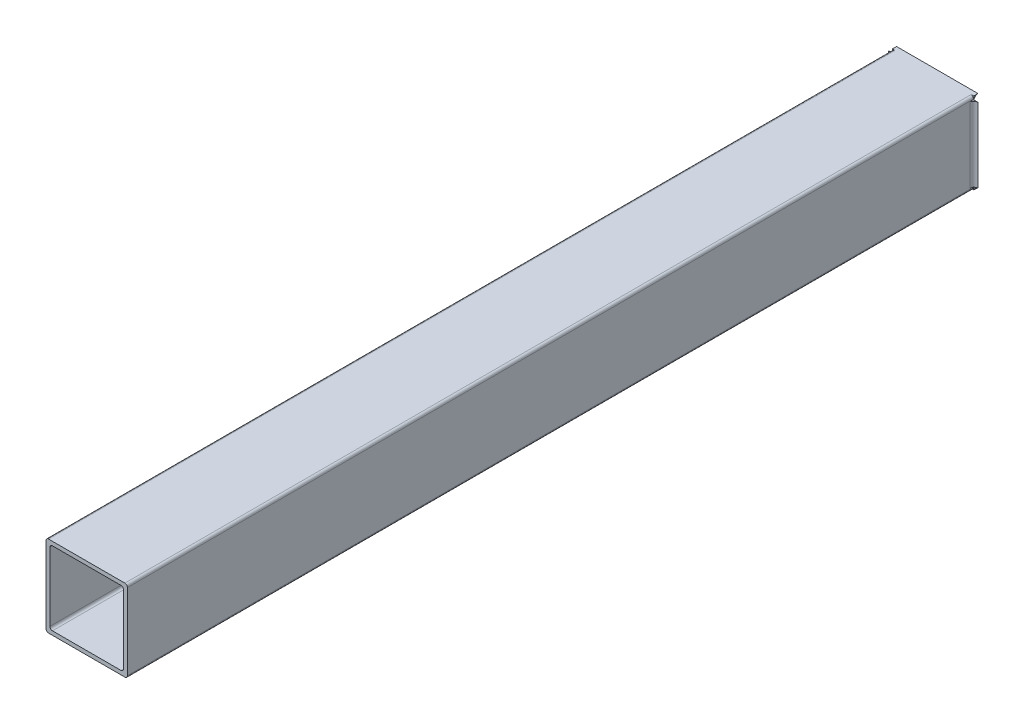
ISO-10303-21;
HEADER;
FILE_DESCRIPTION(('STEP AP214'),'2;1');
FILE_NAME('part.step','',(''),(''),'','','');
FILE_SCHEMA(('AUTOMOTIVE_DESIGN { 1 0 10303 214 1 1 1 1 }'));
ENDSEC;
DATA;
#1=APPLICATION_CONTEXT('core data for automotive mechanical design processes');
#2=APPLICATION_PROTOCOL_DEFINITION('international standard','automotive_design',2000,#1);
#3=PRODUCT_CONTEXT('',#1,'mechanical');
#4=PRODUCT('Part','Part','',(#3));
#5=PRODUCT_RELATED_PRODUCT_CATEGORY('part','',(#4));
#6=PRODUCT_DEFINITION_FORMATION('','',#4);
#7=PRODUCT_DEFINITION_CONTEXT('part definition',#1,'design');
#8=PRODUCT_DEFINITION('design','',#6,#7);
#9=PRODUCT_DEFINITION_SHAPE('','',#8);
#10=(LENGTH_UNIT() NAMED_UNIT(*) SI_UNIT(.MILLI.,.METRE.));
#11=(NAMED_UNIT(*) PLANE_ANGLE_UNIT() SI_UNIT($,.RADIAN.));
#12=(NAMED_UNIT(*) SI_UNIT($,.STERADIAN.) SOLID_ANGLE_UNIT());
#13=UNCERTAINTY_MEASURE_WITH_UNIT(LENGTH_MEASURE(1.E-05),#10,'distance_accuracy_value','');
#14=(GEOMETRIC_REPRESENTATION_CONTEXT(3) GLOBAL_UNCERTAINTY_ASSIGNED_CONTEXT((#13)) GLOBAL_UNIT_ASSIGNED_CONTEXT((#10,
#11,#12)) REPRESENTATION_CONTEXT('',''));
#15=CARTESIAN_POINT('',(0.,0.,0.));
#16=DIRECTION('',(0.,0.,1.));
#17=DIRECTION('',(1.,0.,0.));
#18=AXIS2_PLACEMENT_3D('',#15,#16,#17);
#19=CARTESIAN_POINT('',(31.75,-31.75,660.));
#20=DIRECTION('',(-1.,0.,0.));
#21=DIRECTION('',(0.,-1.,0.));
#22=AXIS2_PLACEMENT_3D('',#19,#20,#21);
#23=PLANE('',#22);
#24=DIRECTION('',(0.,0.,1.));
#25=VECTOR('',#24,1.);
#26=CARTESIAN_POINT('',(31.75,-29.5,3.17499999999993));
#27=LINE('',#26,#25);
#28=CARTESIAN_POINT('',(31.75,-29.5,0.));
#29=VERTEX_POINT('',#28);
#30=CARTESIAN_POINT('',(31.75,-29.5,3.175));
#31=VERTEX_POINT('',#30);
#32=EDGE_CURVE('E683',#29,#31,#27,.T.);
#33=ORIENTED_EDGE('',*,*,#32,.T.);
#34=DIRECTION('',(0.,-1.,0.));
#35=VECTOR('',#34,1.);
#36=CARTESIAN_POINT('',(31.75,29.,3.175));
#37=LINE('',#36,#35);
#38=CARTESIAN_POINT('',(31.75,29.5,3.175));
#39=VERTEX_POINT('',#38);
#40=EDGE_CURVE('E310',#39,#31,#37,.T.);
#41=ORIENTED_EDGE('',*,*,#40,.F.);
#42=DIRECTION('',(0.,0.,1.));
#43=VECTOR('',#42,1.);
#44=CARTESIAN_POINT('',(31.75,29.5,660.));
#45=LINE('',#44,#43);
#46=CARTESIAN_POINT('',(31.75,29.5,0.));
#47=VERTEX_POINT('',#46);
#48=EDGE_CURVE('E605',#39,#47,#45,.F.);
#49=ORIENTED_EDGE('',*,*,#48,.T.);
#50=DIRECTION('',(0.,-1.,0.));
#51=VECTOR('',#50,1.);
#52=CARTESIAN_POINT('',(31.75,29.,0.));
#53=LINE('',#52,#51);
#54=CARTESIAN_POINT('',(31.75,28.575,0.));
#55=VERTEX_POINT('',#54);
#56=EDGE_CURVE('E317',#47,#55,#53,.T.);
#57=ORIENTED_EDGE('',*,*,#56,.T.);
#58=CARTESIAN_POINT('',(31.75,28.575,-3.175));
#59=DIRECTION('',(-1.,0.,0.));
#60=DIRECTION('',(0.,0.,-1.));
#61=AXIS2_PLACEMENT_3D('',#58,#59,#60);
#62=CIRCLE('',#61,3.175);
#63=CARTESIAN_POINT('',(31.75,31.75,-3.175));
#64=VERTEX_POINT('',#63);
#65=EDGE_CURVE('E369',#55,#64,#62,.T.);
#66=ORIENTED_EDGE('',*,*,#65,.T.);
#67=DIRECTION('',(0.,0.,1.));
#68=VECTOR('',#67,1.);
#69=CARTESIAN_POINT('',(31.75,31.75,0.));
#70=LINE('',#69,#68);
#71=CARTESIAN_POINT('',(31.75,31.75,0.));
#72=VERTEX_POINT('',#71);
#73=EDGE_CURVE('E372',#64,#72,#70,.T.);
#74=ORIENTED_EDGE('',*,*,#73,.T.);
#75=DIRECTION('',(0.,-1.,0.));
#76=VECTOR('',#75,1.);
#77=CARTESIAN_POINT('',(31.75,28.575,0.));
#78=LINE('',#77,#76);
#79=CARTESIAN_POINT('',(31.75,31.25,0.));
#80=VERTEX_POINT('',#79);
#81=EDGE_CURVE('E375',#72,#80,#78,.T.);
#82=ORIENTED_EDGE('',*,*,#81,.T.);
#83=CARTESIAN_POINT('',(31.75,31.25,0.));
#84=CARTESIAN_POINT('',(31.75,31.196947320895,3.60679376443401E-05));
#85=CARTESIAN_POINT('',(31.75,31.1439964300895,0.00303424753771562));
#86=CARTESIAN_POINT('',(31.75,31.0387559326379,0.0139753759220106));
#87=CARTESIAN_POINT('',(31.75,30.9864648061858,0.0219032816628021));
#88=CARTESIAN_POINT('',(31.75,30.8833459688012,0.0416082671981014));
#89=CARTESIAN_POINT('',(31.75,30.8325080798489,0.0533343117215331));
#90=CARTESIAN_POINT('',(31.75,30.7316334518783,0.079956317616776));
#91=CARTESIAN_POINT('',(31.75,30.6815974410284,0.0948550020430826));
#92=CARTESIAN_POINT('',(31.75,30.556410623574,0.135649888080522));
#93=CARTESIAN_POINT('',(31.75,30.4818107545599,0.163222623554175));
#94=CARTESIAN_POINT('',(31.75,30.3342411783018,0.222464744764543));
#95=CARTESIAN_POINT('',(31.75,30.2612725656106,0.254136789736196));
#96=CARTESIAN_POINT('',(31.75,30.0436318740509,0.353260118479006));
#97=CARTESIAN_POINT('',(31.75,29.9007733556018,0.424614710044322));
#98=CARTESIAN_POINT('',(31.75,29.7553333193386,0.497333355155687));
#99=CARTESIAN_POINT('',(31.75,29.752666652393,0.498666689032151));
#100=CARTESIAN_POINT('',(31.75,29.75,0.499999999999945));
#101=B_SPLINE_CURVE_WITH_KNOTS('',3,(#83,#84,#85,#86,#87,#88,#89,#90,#91,#92,#93,#94,#95,#96,
#97,#98,#99,#100),.UNSPECIFIED.,.F.,.F.,(4,2,2,2,2,2,2,2,4),(0.,0.158931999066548,
0.317381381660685,0.473784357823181,0.630322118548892,0.868727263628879,1.10728784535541,
1.58615879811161,1.59510307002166),.UNSPECIFIED.);
#102=CARTESIAN_POINT('',(31.75,29.75,0.499999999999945));
#103=VERTEX_POINT('',#102);
#104=EDGE_CURVE('E526',#80,#103,#101,.T.);
#105=ORIENTED_EDGE('',*,*,#104,.T.);
#106=DIRECTION('',(0.,0.,-1.));
#107=VECTOR('',#106,1.);
#108=CARTESIAN_POINT('',(31.75,29.75,660.));
#109=LINE('',#108,#107);
#110=CARTESIAN_POINT('',(31.75,29.75,660.));
#111=VERTEX_POINT('',#110);
#112=EDGE_CURVE('E469',#103,#111,#109,.F.);
#113=ORIENTED_EDGE('',*,*,#112,.T.);
#114=DIRECTION('',(0.,1.,0.));
#115=VECTOR('',#114,1.);
#116=CARTESIAN_POINT('',(31.75,-31.75,660.));
#117=LINE('',#116,#115);
#118=CARTESIAN_POINT('',(31.75,-29.75,660.));
#119=VERTEX_POINT('',#118);
#120=EDGE_CURVE('E414',#119,#111,#117,.T.);
#121=ORIENTED_EDGE('',*,*,#120,.F.);
#122=DIRECTION('',(0.,0.,-1.));
#123=VECTOR('',#122,1.);
#124=CARTESIAN_POINT('',(31.75,-29.75,660.));
#125=LINE('',#124,#123);
#126=CARTESIAN_POINT('',(31.75,-29.75,0.499999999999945));
#127=VERTEX_POINT('',#126);
#128=EDGE_CURVE('E471',#119,#127,#125,.T.);
#129=ORIENTED_EDGE('',*,*,#128,.T.);
#130=CARTESIAN_POINT('',(31.75,-31.25,0.));
#131=CARTESIAN_POINT('',(31.75,-31.1969473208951,3.6067937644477E-05));
#132=CARTESIAN_POINT('',(31.75,-31.1439964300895,0.00303424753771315));
#133=CARTESIAN_POINT('',(31.75,-31.038755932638,0.0139753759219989));
#134=CARTESIAN_POINT('',(31.75,-30.9864648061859,0.0219032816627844));
#135=CARTESIAN_POINT('',(31.75,-30.8833459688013,0.0416082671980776));
#136=CARTESIAN_POINT('',(31.75,-30.832508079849,0.0533343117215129));
#137=CARTESIAN_POINT('',(31.75,-30.7316334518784,0.0799563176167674));
#138=CARTESIAN_POINT('',(31.75,-30.6815974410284,0.0948550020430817));
#139=CARTESIAN_POINT('',(31.75,-30.556410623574,0.13564988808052));
#140=CARTESIAN_POINT('',(31.75,-30.4818107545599,0.163222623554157));
#141=CARTESIAN_POINT('',(31.75,-30.3342411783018,0.222464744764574));
#142=CARTESIAN_POINT('',(31.75,-30.2612725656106,0.254136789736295));
#143=CARTESIAN_POINT('',(31.75,-30.0436318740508,0.353260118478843));
#144=CARTESIAN_POINT('',(31.75,-29.9007733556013,0.424614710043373));
#145=CARTESIAN_POINT('',(31.75,-29.7553333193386,0.497333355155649));
#146=CARTESIAN_POINT('',(31.75,-29.752666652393,0.498666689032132));
#147=CARTESIAN_POINT('',(31.75,-29.75,0.499999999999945));
#148=B_SPLINE_CURVE_WITH_KNOTS('',3,(#130,#131,#132,#133,#134,#135,#136,#137,#138,#139,#140,
#141,#142,#143,#144,#145,#146,#147),.UNSPECIFIED.,.F.,.F.,(4,2,2,2,2,2,2,2,4),(0.,
0.158931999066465,0.317381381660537,0.473784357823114,0.630322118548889,0.868727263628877,
1.10728784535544,1.58615879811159,1.59510307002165),.UNSPECIFIED.);
#149=CARTESIAN_POINT('',(31.75,-31.25,0.));
#150=VERTEX_POINT('',#149);
#151=EDGE_CURVE('E569',#127,#150,#148,.F.);
#152=ORIENTED_EDGE('',*,*,#151,.T.);
#153=DIRECTION('',(0.,-1.,0.));
#154=VECTOR('',#153,1.);
#155=CARTESIAN_POINT('',(31.75,-28.575,0.));
#156=LINE('',#155,#154);
#157=CARTESIAN_POINT('',(31.75,-31.75,0.));
#158=VERTEX_POINT('',#157);
#159=EDGE_CURVE('E343',#150,#158,#156,.T.);
#160=ORIENTED_EDGE('',*,*,#159,.T.);
#161=DIRECTION('',(0.,0.,-1.));
#162=VECTOR('',#161,1.);
#163=CARTESIAN_POINT('',(31.75,-31.75,0.));
#164=LINE('',#163,#162);
#165=CARTESIAN_POINT('',(31.75,-31.75,-3.175));
#166=VERTEX_POINT('',#165);
#167=EDGE_CURVE('E346',#158,#166,#164,.T.);
#168=ORIENTED_EDGE('',*,*,#167,.T.);
#169=CARTESIAN_POINT('',(31.75,-28.575,-3.175));
#170=DIRECTION('',(-1.,0.,0.));
#171=DIRECTION('',(0.,0.,-1.));
#172=AXIS2_PLACEMENT_3D('',#169,#170,#171);
#173=CIRCLE('',#172,3.175);
#174=CARTESIAN_POINT('',(31.75,-28.575,0.));
#175=VERTEX_POINT('',#174);
#176=EDGE_CURVE('E341',#166,#175,#173,.T.);
#177=ORIENTED_EDGE('',*,*,#176,.T.);
#178=EDGE_CURVE('E322',#175,#29,#53,.T.);
#179=ORIENTED_EDGE('',*,*,#178,.T.);
#180=EDGE_LOOP('',(#33,#41,#49,#57,#66,#74,#82,#105,#113,#121,#129,#152,#160,#168,#177,#179));
#181=FACE_BOUND('',#180,.T.);
#182=ADVANCED_FACE('F39',(#181),#23,.F.);
#183=CARTESIAN_POINT('',(-31.75,-31.75,660.));
#184=DIRECTION('',(1.,0.,0.));
#185=DIRECTION('',(0.,1.,0.));
#186=AXIS2_PLACEMENT_3D('',#183,#184,#185);
#187=PLANE('',#186);
#188=DIRECTION('',(0.,0.,-1.));
#189=VECTOR('',#188,1.);
#190=CARTESIAN_POINT('',(-31.75,-29.5,0.));
#191=LINE('',#190,#189);
#192=CARTESIAN_POINT('',(-31.75,-29.5,3.175));
#193=VERTEX_POINT('',#192);
#194=CARTESIAN_POINT('',(-31.75,-29.5,0.));
#195=VERTEX_POINT('',#194);
#196=EDGE_CURVE('E696',#193,#195,#191,.T.);
#197=ORIENTED_EDGE('',*,*,#196,.T.);
#198=DIRECTION('',(0.,-1.,0.));
#199=VECTOR('',#198,1.);
#200=CARTESIAN_POINT('',(-31.75,29.,0.));
#201=LINE('',#200,#199);
#202=CARTESIAN_POINT('',(-31.75,-28.575,0.));
#203=VERTEX_POINT('',#202);
#204=EDGE_CURVE('E334',#203,#195,#201,.T.);
#205=ORIENTED_EDGE('',*,*,#204,.F.);
#206=CARTESIAN_POINT('',(-31.75,-28.575,-3.175));
#207=DIRECTION('',(-1.,0.,0.));
#208=DIRECTION('',(0.,0.,-1.));
#209=AXIS2_PLACEMENT_3D('',#206,#207,#208);
#210=CIRCLE('',#209,3.175);
#211=CARTESIAN_POINT('',(-31.75,-31.75,-3.175));
#212=VERTEX_POINT('',#211);
#213=EDGE_CURVE('E340',#212,#203,#210,.T.);
#214=ORIENTED_EDGE('',*,*,#213,.F.);
#215=DIRECTION('',(0.,0.,-1.));
#216=VECTOR('',#215,1.);
#217=CARTESIAN_POINT('',(-31.75,-31.75,0.));
#218=LINE('',#217,#216);
#219=CARTESIAN_POINT('',(-31.75,-31.75,0.));
#220=VERTEX_POINT('',#219);
#221=EDGE_CURVE('E344',#220,#212,#218,.T.);
#222=ORIENTED_EDGE('',*,*,#221,.F.);
#223=DIRECTION('',(0.,-1.,0.));
#224=VECTOR('',#223,1.);
#225=CARTESIAN_POINT('',(-31.75,-28.575,0.));
#226=LINE('',#225,#224);
#227=CARTESIAN_POINT('',(-31.75,-31.25,0.));
#228=VERTEX_POINT('',#227);
#229=EDGE_CURVE('E351',#228,#220,#226,.T.);
#230=ORIENTED_EDGE('',*,*,#229,.F.);
#231=CARTESIAN_POINT('',(-31.75,-31.25,0.));
#232=CARTESIAN_POINT('',(-31.75,-31.1969473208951,3.60679376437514E-05));
#233=CARTESIAN_POINT('',(-31.75,-31.1439964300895,0.0030342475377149));
#234=CARTESIAN_POINT('',(-31.75,-31.0387559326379,0.0139753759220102));
#235=CARTESIAN_POINT('',(-31.75,-30.9864648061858,0.0219032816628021));
#236=CARTESIAN_POINT('',(-31.75,-30.8833459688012,0.0416082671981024));
#237=CARTESIAN_POINT('',(-31.75,-30.8325080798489,0.0533343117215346));
#238=CARTESIAN_POINT('',(-31.75,-30.7316334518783,0.0799563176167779));
#239=CARTESIAN_POINT('',(-31.75,-30.6815974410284,0.0948550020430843));
#240=CARTESIAN_POINT('',(-31.75,-30.556410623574,0.135649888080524));
#241=CARTESIAN_POINT('',(-31.75,-30.4818107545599,0.163222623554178));
#242=CARTESIAN_POINT('',(-31.75,-30.3342411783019,0.222464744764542));
#243=CARTESIAN_POINT('',(-31.75,-30.2612725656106,0.254136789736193));
#244=CARTESIAN_POINT('',(-31.75,-30.0436318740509,0.353260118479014));
#245=CARTESIAN_POINT('',(-31.75,-29.9007733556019,0.42461471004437));
#246=CARTESIAN_POINT('',(-31.75,-29.7553333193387,0.497333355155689));
#247=CARTESIAN_POINT('',(-31.75,-29.752666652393,0.498666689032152));
#248=CARTESIAN_POINT('',(-31.75,-29.75,0.499999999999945));
#249=B_SPLINE_CURVE_WITH_KNOTS('',3,(#231,#232,#233,#234,#235,#236,#237,#238,#239,#240,#241,
#242,#243,#244,#245,#246,#247,#248),.UNSPECIFIED.,.F.,.F.,(4,2,2,2,2,2,2,2,4),(0.,
0.158931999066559,0.317381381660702,0.473784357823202,0.630322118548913,0.868727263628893,
1.10728784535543,1.58615879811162,1.59510307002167),.UNSPECIFIED.);
#250=CARTESIAN_POINT('',(-31.75,-29.75,0.499999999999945));
#251=VERTEX_POINT('',#250);
#252=EDGE_CURVE('E575',#228,#251,#249,.T.);
#253=ORIENTED_EDGE('',*,*,#252,.T.);
#254=DIRECTION('',(0.,0.,-1.));
#255=VECTOR('',#254,1.);
#256=CARTESIAN_POINT('',(-31.75,-29.75,660.));
#257=LINE('',#256,#255);
#258=CARTESIAN_POINT('',(-31.75,-29.75,660.));
#259=VERTEX_POINT('',#258);
#260=EDGE_CURVE('E459',#251,#259,#257,.F.);
#261=ORIENTED_EDGE('',*,*,#260,.T.);
#262=DIRECTION('',(0.,-1.,0.));
#263=VECTOR('',#262,1.);
#264=CARTESIAN_POINT('',(-31.75,-31.75,660.));
#265=LINE('',#264,#263);
#266=CARTESIAN_POINT('',(-31.75,29.75,660.));
#267=VERTEX_POINT('',#266);
#268=EDGE_CURVE('E430',#267,#259,#265,.T.);
#269=ORIENTED_EDGE('',*,*,#268,.F.);
#270=DIRECTION('',(0.,0.,-1.));
#271=VECTOR('',#270,1.);
#272=CARTESIAN_POINT('',(-31.75,29.75,660.));
#273=LINE('',#272,#271);
#274=CARTESIAN_POINT('',(-31.75,29.75,0.499999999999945));
#275=VERTEX_POINT('',#274);
#276=EDGE_CURVE('E456',#267,#275,#273,.T.);
#277=ORIENTED_EDGE('',*,*,#276,.T.);
#278=CARTESIAN_POINT('',(-31.75,31.25,0.));
#279=CARTESIAN_POINT('',(-31.75,31.1969473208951,3.60679376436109E-05));
#280=CARTESIAN_POINT('',(-31.75,31.1439964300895,0.00303424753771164));
#281=CARTESIAN_POINT('',(-31.75,31.038755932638,0.013975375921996));
#282=CARTESIAN_POINT('',(-31.75,30.9864648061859,0.0219032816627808));
#283=CARTESIAN_POINT('',(-31.75,30.8833459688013,0.041608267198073));
#284=CARTESIAN_POINT('',(-31.75,30.832508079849,0.0533343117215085));
#285=CARTESIAN_POINT('',(-31.75,30.7316334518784,0.0799563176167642));
#286=CARTESIAN_POINT('',(-31.75,30.6815974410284,0.0948550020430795));
#287=CARTESIAN_POINT('',(-31.75,30.556410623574,0.135649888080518));
#288=CARTESIAN_POINT('',(-31.75,30.4818107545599,0.163222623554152));
#289=CARTESIAN_POINT('',(-31.75,30.3342411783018,0.222464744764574));
#290=CARTESIAN_POINT('',(-31.75,30.2612725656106,0.254136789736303));
#291=CARTESIAN_POINT('',(-31.75,30.0436318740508,0.353260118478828));
#292=CARTESIAN_POINT('',(-31.75,29.9007733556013,0.424614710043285));
#293=CARTESIAN_POINT('',(-31.75,29.7553333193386,0.497333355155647));
#294=CARTESIAN_POINT('',(-31.75,29.752666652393,0.49866668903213));
#295=CARTESIAN_POINT('',(-31.75,29.75,0.499999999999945));
#296=B_SPLINE_CURVE_WITH_KNOTS('',3,(#278,#279,#280,#281,#282,#283,#284,#285,#286,#287,#288,
#289,#290,#291,#292,#293,#294,#295),.UNSPECIFIED.,.F.,.F.,(4,2,2,2,2,2,2,2,4),(0.,
0.158931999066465,0.317381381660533,0.47378435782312,0.630322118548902,0.868727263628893,
1.10728784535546,1.58615879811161,1.59510307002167),.UNSPECIFIED.);
#297=CARTESIAN_POINT('',(-31.75,31.25,0.));
#298=VERTEX_POINT('',#297);
#299=EDGE_CURVE('E599',#275,#298,#296,.F.);
#300=ORIENTED_EDGE('',*,*,#299,.T.);
#301=DIRECTION('',(0.,-1.,0.));
#302=VECTOR('',#301,1.);
#303=CARTESIAN_POINT('',(-31.75,28.575,0.));
#304=LINE('',#303,#302);
#305=CARTESIAN_POINT('',(-31.75,31.75,0.));
#306=VERTEX_POINT('',#305);
#307=EDGE_CURVE('E373',#306,#298,#304,.T.);
#308=ORIENTED_EDGE('',*,*,#307,.F.);
#309=DIRECTION('',(0.,0.,1.));
#310=VECTOR('',#309,1.);
#311=CARTESIAN_POINT('',(-31.75,31.75,0.));
#312=LINE('',#311,#310);
#313=CARTESIAN_POINT('',(-31.75,31.75,-3.175));
#314=VERTEX_POINT('',#313);
#315=EDGE_CURVE('E381',#314,#306,#312,.T.);
#316=ORIENTED_EDGE('',*,*,#315,.F.);
#317=CARTESIAN_POINT('',(-31.75,28.575,-3.175));
#318=DIRECTION('',(-1.,0.,0.));
#319=DIRECTION('',(0.,0.,-1.));
#320=AXIS2_PLACEMENT_3D('',#317,#318,#319);
#321=CIRCLE('',#320,3.175);
#322=CARTESIAN_POINT('',(-31.75,28.575,0.));
#323=VERTEX_POINT('',#322);
#324=EDGE_CURVE('E368',#323,#314,#321,.T.);
#325=ORIENTED_EDGE('',*,*,#324,.F.);
#326=CARTESIAN_POINT('',(-31.75,29.5,0.));
#327=VERTEX_POINT('',#326);
#328=EDGE_CURVE('E335',#327,#323,#201,.T.);
#329=ORIENTED_EDGE('',*,*,#328,.F.);
#330=DIRECTION('',(0.,0.,-1.));
#331=VECTOR('',#330,1.);
#332=CARTESIAN_POINT('',(-31.75,29.5,660.));
#333=LINE('',#332,#331);
#334=CARTESIAN_POINT('',(-31.75,29.5,3.175));
#335=VERTEX_POINT('',#334);
#336=EDGE_CURVE('E693',#327,#335,#333,.F.);
#337=ORIENTED_EDGE('',*,*,#336,.T.);
#338=DIRECTION('',(0.,-1.,0.));
#339=VECTOR('',#338,1.);
#340=CARTESIAN_POINT('',(-31.75,29.,3.175));
#341=LINE('',#340,#339);
#342=EDGE_CURVE('E338',#335,#193,#341,.T.);
#343=ORIENTED_EDGE('',*,*,#342,.T.);
#344=EDGE_LOOP('',(#197,#205,#214,#222,#230,#253,#261,#269,#277,#300,#308,#316,#325,#329,#337,#343));
#345=FACE_BOUND('',#344,.T.);
#346=ADVANCED_FACE('F588',(#345),#187,.F.);
#347=CARTESIAN_POINT('',(0.,0.,0.));
#348=DIRECTION('',(0.,0.,-1.));
#349=DIRECTION('',(-1.,0.,0.));
#350=AXIS2_PLACEMENT_3D('',#347,#348,#349);
#351=PLANE('',#350);
#352=DIRECTION('',(-1.,0.,0.));
#353=VECTOR('',#352,1.);
#354=CARTESIAN_POINT('',(31.75,28.575,0.));
#355=LINE('',#354,#353);
#356=CARTESIAN_POINT('',(27.4033351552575,28.575,0.));
#357=VERTEX_POINT('',#356);
#358=EDGE_CURVE('E386',#55,#357,#355,.T.);
#359=ORIENTED_EDGE('',*,*,#358,.F.);
#360=ORIENTED_EDGE('',*,*,#56,.F.);
#361=CARTESIAN_POINT('',(32.25,29.5,0.));
#362=DIRECTION('',(0.,0.,-1.));
#363=DIRECTION('',(-1.,0.,0.));
#364=AXIS2_PLACEMENT_3D('',#361,#362,#363);
#365=CIRCLE('',#364,0.5);
#366=CARTESIAN_POINT('',(32.25,29.,0.));
#367=VERTEX_POINT('',#366);
#368=EDGE_CURVE('E309',#47,#367,#365,.F.);
#369=ORIENTED_EDGE('',*,*,#368,.T.);
#370=DIRECTION('',(-1.,0.,0.));
#371=VECTOR('',#370,1.);
#372=CARTESIAN_POINT('',(34.925,29.,0.));
#373=LINE('',#372,#371);
#374=CARTESIAN_POINT('',(34.925,29.,0.));
#375=VERTEX_POINT('',#374);
#376=EDGE_CURVE('E294',#375,#367,#373,.T.);
#377=ORIENTED_EDGE('',*,*,#376,.F.);
#378=DIRECTION('',(0.,-1.,0.));
#379=VECTOR('',#378,1.);
#380=CARTESIAN_POINT('',(34.925,29.,0.));
#381=LINE('',#380,#379);
#382=CARTESIAN_POINT('',(34.925,-29.,0.));
#383=VERTEX_POINT('',#382);
#384=EDGE_CURVE('E307',#375,#383,#381,.T.);
#385=ORIENTED_EDGE('',*,*,#384,.T.);
#386=DIRECTION('',(-1.,0.,0.));
#387=VECTOR('',#386,1.);
#388=CARTESIAN_POINT('',(34.925,-29.,0.));
#389=LINE('',#388,#387);
#390=CARTESIAN_POINT('',(32.25,-29.,0.));
#391=VERTEX_POINT('',#390);
#392=EDGE_CURVE('E300',#383,#391,#389,.T.);
#393=ORIENTED_EDGE('',*,*,#392,.T.);
#394=CARTESIAN_POINT('',(32.25,-29.5,0.));
#395=DIRECTION('',(0.,0.,-1.));
#396=DIRECTION('',(-1.,0.,0.));
#397=AXIS2_PLACEMENT_3D('',#394,#395,#396);
#398=CIRCLE('',#397,0.5);
#399=EDGE_CURVE('E636',#391,#29,#398,.F.);
#400=ORIENTED_EDGE('',*,*,#399,.T.);
#401=ORIENTED_EDGE('',*,*,#178,.F.);
#402=DIRECTION('',(-1.,0.,0.));
#403=VECTOR('',#402,1.);
#404=CARTESIAN_POINT('',(31.75,-28.575,0.));
#405=LINE('',#404,#403);
#406=CARTESIAN_POINT('',(27.4033351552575,-28.575,0.));
#407=VERTEX_POINT('',#406);
#408=EDGE_CURVE('E362',#175,#407,#405,.T.);
#409=ORIENTED_EDGE('',*,*,#408,.T.);
#410=CARTESIAN_POINT('',(26.702,-26.702,0.));
#411=DIRECTION('',(0.,0.,-1.));
#412=DIRECTION('',(-1.,0.,0.));
#413=AXIS2_PLACEMENT_3D('',#410,#411,#412);
#414=CIRCLE('',#413,2.);
#415=CARTESIAN_POINT('',(28.702,-26.702,0.));
#416=VERTEX_POINT('',#415);
#417=EDGE_CURVE('E484',#407,#416,#414,.F.);
#418=ORIENTED_EDGE('',*,*,#417,.T.);
#419=DIRECTION('',(0.,1.,0.));
#420=VECTOR('',#419,1.);
#421=CARTESIAN_POINT('',(28.702,-28.702,0.));
#422=LINE('',#421,#420);
#423=CARTESIAN_POINT('',(28.702,26.702,0.));
#424=VERTEX_POINT('',#423);
#425=EDGE_CURVE('E400',#416,#424,#422,.T.);
#426=ORIENTED_EDGE('',*,*,#425,.T.);
#427=CARTESIAN_POINT('',(26.702,26.702,0.));
#428=DIRECTION('',(0.,0.,-1.));
#429=DIRECTION('',(-1.,0.,0.));
#430=AXIS2_PLACEMENT_3D('',#427,#428,#429);
#431=CIRCLE('',#430,2.);
#432=EDGE_CURVE('E501',#424,#357,#431,.F.);
#433=ORIENTED_EDGE('',*,*,#432,.T.);
#434=EDGE_LOOP('',(#359,#360,#369,#377,#385,#393,#400,#401,#409,#418,#426,#433));
#435=FACE_BOUND('',#434,.T.);
#436=ADVANCED_FACE('F305',(#435),#351,.T.);
#437=CARTESIAN_POINT('',(-26.702,-26.702,0.));
#438=DIRECTION('',(0.,0.,-1.));
#439=DIRECTION('',(-1.,0.,0.));
#440=AXIS2_PLACEMENT_3D('',#437,#438,#439);
#441=CIRCLE('',#440,2.);
#442=CARTESIAN_POINT('',(-28.702,-26.702,0.));
#443=VERTEX_POINT('',#442);
#444=CARTESIAN_POINT('',(-27.4033351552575,-28.575,0.));
#445=VERTEX_POINT('',#444);
#446=EDGE_CURVE('E490',#443,#445,#441,.F.);
#447=ORIENTED_EDGE('',*,*,#446,.T.);
#448=EDGE_CURVE('E361',#445,#203,#405,.T.);
#449=ORIENTED_EDGE('',*,*,#448,.T.);
#450=ORIENTED_EDGE('',*,*,#204,.T.);
#451=CARTESIAN_POINT('',(-32.25,-29.5,0.));
#452=DIRECTION('',(0.,0.,-1.));
#453=DIRECTION('',(-1.,0.,0.));
#454=AXIS2_PLACEMENT_3D('',#451,#452,#453);
#455=CIRCLE('',#454,0.5);
#456=CARTESIAN_POINT('',(-32.25,-29.,0.));
#457=VERTEX_POINT('',#456);
#458=EDGE_CURVE('E656',#195,#457,#455,.F.);
#459=ORIENTED_EDGE('',*,*,#458,.T.);
#460=DIRECTION('',(-1.,0.,0.));
#461=VECTOR('',#460,1.);
#462=CARTESIAN_POINT('',(-34.925,-29.,0.));
#463=LINE('',#462,#461);
#464=CARTESIAN_POINT('',(-34.925,-29.,0.));
#465=VERTEX_POINT('',#464);
#466=EDGE_CURVE('E320',#457,#465,#463,.T.);
#467=ORIENTED_EDGE('',*,*,#466,.T.);
#468=DIRECTION('',(0.,-1.,0.));
#469=VECTOR('',#468,1.);
#470=CARTESIAN_POINT('',(-34.925,29.,0.));
#471=LINE('',#470,#469);
#472=CARTESIAN_POINT('',(-34.925,29.,0.));
#473=VERTEX_POINT('',#472);
#474=EDGE_CURVE('E329',#473,#465,#471,.T.);
#475=ORIENTED_EDGE('',*,*,#474,.F.);
#476=DIRECTION('',(-1.,0.,0.));
#477=VECTOR('',#476,1.);
#478=CARTESIAN_POINT('',(-34.925,29.,0.));
#479=LINE('',#478,#477);
#480=CARTESIAN_POINT('',(-32.25,29.,0.));
#481=VERTEX_POINT('',#480);
#482=EDGE_CURVE('E328',#481,#473,#479,.T.);
#483=ORIENTED_EDGE('',*,*,#482,.F.);
#484=CARTESIAN_POINT('',(-32.25,29.5,0.));
#485=DIRECTION('',(0.,0.,-1.));
#486=DIRECTION('',(-1.,0.,0.));
#487=AXIS2_PLACEMENT_3D('',#484,#485,#486);
#488=CIRCLE('',#487,0.5);
#489=EDGE_CURVE('E53',#481,#327,#488,.F.);
#490=ORIENTED_EDGE('',*,*,#489,.T.);
#491=ORIENTED_EDGE('',*,*,#328,.T.);
#492=CARTESIAN_POINT('',(-27.4033351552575,28.575,0.));
#493=VERTEX_POINT('',#492);
#494=EDGE_CURVE('E378',#493,#323,#355,.T.);
#495=ORIENTED_EDGE('',*,*,#494,.F.);
#496=CARTESIAN_POINT('',(-26.702,26.702,0.));
#497=DIRECTION('',(0.,0.,-1.));
#498=DIRECTION('',(-1.,0.,0.));
#499=AXIS2_PLACEMENT_3D('',#496,#497,#498);
#500=CIRCLE('',#499,2.);
#501=CARTESIAN_POINT('',(-28.702,26.702,0.));
#502=VERTEX_POINT('',#501);
#503=EDGE_CURVE('E495',#493,#502,#500,.F.);
#504=ORIENTED_EDGE('',*,*,#503,.T.);
#505=DIRECTION('',(0.,-1.,0.));
#506=VECTOR('',#505,1.);
#507=CARTESIAN_POINT('',(-28.702,-28.702,0.));
#508=LINE('',#507,#506);
#509=EDGE_CURVE('E420',#502,#443,#508,.T.);
#510=ORIENTED_EDGE('',*,*,#509,.T.);
#511=EDGE_LOOP('',(#447,#449,#450,#459,#467,#475,#483,#490,#491,#495,#504,#510));
#512=FACE_BOUND('',#511,.T.);
#513=ADVANCED_FACE('F707',(#512),#351,.T.);
#514=CARTESIAN_POINT('',(0.,0.,660.));
#515=DIRECTION('',(0.,0.,-1.));
#516=DIRECTION('',(-1.,0.,0.));
#517=AXIS2_PLACEMENT_3D('',#514,#515,#516);
#518=PLANE('',#517);
#519=ORIENTED_EDGE('',*,*,#268,.T.);
#520=CARTESIAN_POINT('',(-29.75,-29.75,660.));
#521=DIRECTION('',(0.,0.,-1.));
#522=DIRECTION('',(-1.,0.,0.));
#523=AXIS2_PLACEMENT_3D('',#520,#521,#522);
#524=CIRCLE('',#523,2.);
#525=CARTESIAN_POINT('',(-29.75,-31.75,660.));
#526=VERTEX_POINT('',#525);
#527=EDGE_CURVE('E467',#259,#526,#524,.F.);
#528=ORIENTED_EDGE('',*,*,#527,.T.);
#529=DIRECTION('',(1.,0.,0.));
#530=VECTOR('',#529,1.);
#531=CARTESIAN_POINT('',(-31.75,-31.75,660.));
#532=LINE('',#531,#530);
#533=CARTESIAN_POINT('',(29.75,-31.75,660.));
#534=VERTEX_POINT('',#533);
#535=EDGE_CURVE('E433',#526,#534,#532,.T.);
#536=ORIENTED_EDGE('',*,*,#535,.T.);
#537=CARTESIAN_POINT('',(29.75,-29.75,660.));
#538=DIRECTION('',(0.,0.,-1.));
#539=DIRECTION('',(-1.,0.,0.));
#540=AXIS2_PLACEMENT_3D('',#537,#538,#539);
#541=CIRCLE('',#540,2.);
#542=EDGE_CURVE('E465',#534,#119,#541,.F.);
#543=ORIENTED_EDGE('',*,*,#542,.T.);
#544=ORIENTED_EDGE('',*,*,#120,.T.);
#545=CARTESIAN_POINT('',(29.75,29.75,660.));
#546=DIRECTION('',(0.,0.,-1.));
#547=DIRECTION('',(-1.,0.,0.));
#548=AXIS2_PLACEMENT_3D('',#545,#546,#547);
#549=CIRCLE('',#548,2.);
#550=CARTESIAN_POINT('',(29.75,31.75,660.));
#551=VERTEX_POINT('',#550);
#552=EDGE_CURVE('E463',#111,#551,#549,.F.);
#553=ORIENTED_EDGE('',*,*,#552,.T.);
#554=DIRECTION('',(-1.,0.,0.));
#555=VECTOR('',#554,1.);
#556=CARTESIAN_POINT('',(-31.75,31.75,660.));
#557=LINE('',#556,#555);
#558=CARTESIAN_POINT('',(-29.75,31.75,660.));
#559=VERTEX_POINT('',#558);
#560=EDGE_CURVE('E427',#551,#559,#557,.T.);
#561=ORIENTED_EDGE('',*,*,#560,.T.);
#562=CARTESIAN_POINT('',(-29.75,29.75,660.));
#563=DIRECTION('',(0.,0.,-1.));
#564=DIRECTION('',(-1.,0.,0.));
#565=AXIS2_PLACEMENT_3D('',#562,#563,#564);
#566=CIRCLE('',#565,2.);
#567=EDGE_CURVE('E461',#559,#267,#566,.F.);
#568=ORIENTED_EDGE('',*,*,#567,.T.);
#569=EDGE_LOOP('',(#519,#528,#536,#543,#544,#553,#561,#568));
#570=FACE_BOUND('',#569,.T.);
#571=DIRECTION('',(0.,1.,0.));
#572=VECTOR('',#571,1.);
#573=CARTESIAN_POINT('',(28.702,-28.702,660.));
#574=LINE('',#573,#572);
#575=CARTESIAN_POINT('',(28.702,-26.702,660.));
#576=VERTEX_POINT('',#575);
#577=CARTESIAN_POINT('',(28.702,26.702,660.));
#578=VERTEX_POINT('',#577);
#579=EDGE_CURVE('E401',#576,#578,#574,.T.);
#580=ORIENTED_EDGE('',*,*,#579,.F.);
#581=CARTESIAN_POINT('',(26.702,-26.702,660.));
#582=DIRECTION('',(0.,0.,-1.));
#583=DIRECTION('',(-1.,0.,0.));
#584=AXIS2_PLACEMENT_3D('',#581,#582,#583);
#585=CIRCLE('',#584,2.);
#586=CARTESIAN_POINT('',(26.702,-28.702,660.));
#587=VERTEX_POINT('',#586);
#588=EDGE_CURVE('E488',#576,#587,#585,.T.);
#589=ORIENTED_EDGE('',*,*,#588,.T.);
#590=DIRECTION('',(1.,0.,0.));
#591=VECTOR('',#590,1.);
#592=CARTESIAN_POINT('',(-28.702,-28.702,660.));
#593=LINE('',#592,#591);
#594=CARTESIAN_POINT('',(-26.702,-28.702,660.));
#595=VERTEX_POINT('',#594);
#596=EDGE_CURVE('E411',#595,#587,#593,.T.);
#597=ORIENTED_EDGE('',*,*,#596,.F.);
#598=CARTESIAN_POINT('',(-26.702,-26.702,660.));
#599=DIRECTION('',(0.,0.,-1.));
#600=DIRECTION('',(-1.,0.,0.));
#601=AXIS2_PLACEMENT_3D('',#598,#599,#600);
#602=CIRCLE('',#601,2.);
#603=CARTESIAN_POINT('',(-28.702,-26.702,660.));
#604=VERTEX_POINT('',#603);
#605=EDGE_CURVE('E493',#595,#604,#602,.T.);
#606=ORIENTED_EDGE('',*,*,#605,.T.);
#607=DIRECTION('',(0.,-1.,0.));
#608=VECTOR('',#607,1.);
#609=CARTESIAN_POINT('',(-28.702,-28.702,660.));
#610=LINE('',#609,#608);
#611=CARTESIAN_POINT('',(-28.702,26.702,660.));
#612=VERTEX_POINT('',#611);
#613=EDGE_CURVE('E408',#612,#604,#610,.T.);
#614=ORIENTED_EDGE('',*,*,#613,.F.);
#615=CARTESIAN_POINT('',(-26.702,26.702,660.));
#616=DIRECTION('',(0.,0.,-1.));
#617=DIRECTION('',(-1.,0.,0.));
#618=AXIS2_PLACEMENT_3D('',#615,#616,#617);
#619=CIRCLE('',#618,2.);
#620=CARTESIAN_POINT('',(-26.702,28.702,660.));
#621=VERTEX_POINT('',#620);
#622=EDGE_CURVE('E499',#612,#621,#619,.T.);
#623=ORIENTED_EDGE('',*,*,#622,.T.);
#624=DIRECTION('',(-1.,0.,0.));
#625=VECTOR('',#624,1.);
#626=CARTESIAN_POINT('',(-28.702,28.702,660.));
#627=LINE('',#626,#625);
#628=CARTESIAN_POINT('',(26.702,28.702,660.));
#629=VERTEX_POINT('',#628);
#630=EDGE_CURVE('E404',#629,#621,#627,.T.);
#631=ORIENTED_EDGE('',*,*,#630,.F.);
#632=CARTESIAN_POINT('',(26.702,26.702,660.));
#633=DIRECTION('',(0.,0.,-1.));
#634=DIRECTION('',(-1.,0.,0.));
#635=AXIS2_PLACEMENT_3D('',#632,#633,#634);
#636=CIRCLE('',#635,2.);
#637=EDGE_CURVE('E504',#629,#578,#636,.T.);
#638=ORIENTED_EDGE('',*,*,#637,.T.);
#639=EDGE_LOOP('',(#580,#589,#597,#606,#614,#623,#631,#638));
#640=FACE_BOUND('',#639,.T.);
#641=ADVANCED_FACE('F747',(#570,#640),#518,.F.);
#642=CARTESIAN_POINT('',(-31.75,31.75,660.));
#643=DIRECTION('',(0.,-1.,0.));
#644=DIRECTION('',(0.,0.,-1.));
#645=AXIS2_PLACEMENT_3D('',#642,#643,#644);
#646=PLANE('',#645);
#647=ORIENTED_EDGE('',*,*,#560,.F.);
#648=DIRECTION('',(0.,0.,-1.));
#649=VECTOR('',#648,1.);
#650=CARTESIAN_POINT('',(29.75,31.75,660.));
#651=LINE('',#650,#649);
#652=CARTESIAN_POINT('',(29.75,31.75,0.499999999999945));
#653=VERTEX_POINT('',#652);
#654=EDGE_CURVE('E481',#551,#653,#651,.T.);
#655=ORIENTED_EDGE('',*,*,#654,.T.);
#656=CARTESIAN_POINT('',(31.25,31.75,0.));
#657=CARTESIAN_POINT('',(31.196947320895,31.75,3.60679376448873E-05));
#658=CARTESIAN_POINT('',(31.1439964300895,31.75,0.00303424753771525));
#659=CARTESIAN_POINT('',(31.038755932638,31.75,0.0139753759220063));
#660=CARTESIAN_POINT('',(30.9864648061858,31.75,0.021903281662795));
#661=CARTESIAN_POINT('',(30.8833459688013,31.75,0.0416082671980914));
#662=CARTESIAN_POINT('',(30.8325080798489,31.75,0.0533343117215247));
#663=CARTESIAN_POINT('',(30.7316334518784,31.75,0.0799563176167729));
#664=CARTESIAN_POINT('',(30.6815974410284,31.75,0.094855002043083));
#665=CARTESIAN_POINT('',(30.556410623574,31.75,0.135649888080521));
#666=CARTESIAN_POINT('',(30.4818107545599,31.75,0.163222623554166));
#667=CARTESIAN_POINT('',(30.3342411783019,31.75,0.222464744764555));
#668=CARTESIAN_POINT('',(30.2612725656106,31.75,0.25413678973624));
#669=CARTESIAN_POINT('',(30.0436318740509,31.75,0.353260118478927));
#670=CARTESIAN_POINT('',(29.9007733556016,31.75,0.424614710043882));
#671=CARTESIAN_POINT('',(29.7553333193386,31.75,0.497333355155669));
#672=CARTESIAN_POINT('',(29.752666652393,31.75,0.498666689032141));
#673=CARTESIAN_POINT('',(29.75,31.75,0.499999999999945));
#674=B_SPLINE_CURVE_WITH_KNOTS('',3,(#656,#657,#658,#659,#660,#661,#662,#663,#664,#665,#666,
#667,#668,#669,#670,#671,#672,#673),.UNSPECIFIED.,.F.,.F.,(4,2,2,2,2,2,2,2,4),(0.,
0.15893199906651,0.317381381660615,0.473784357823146,0.630322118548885,0.868727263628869,
1.10728784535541,1.58615879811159,1.59510307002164),.UNSPECIFIED.);
#675=CARTESIAN_POINT('',(31.25,31.75,0.));
#676=VERTEX_POINT('',#675);
#677=EDGE_CURVE('E534',#653,#676,#674,.F.);
#678=ORIENTED_EDGE('',*,*,#677,.T.);
#679=DIRECTION('',(-1.,0.,0.));
#680=VECTOR('',#679,1.);
#681=CARTESIAN_POINT('',(31.75,31.75,0.));
#682=LINE('',#681,#680);
#683=EDGE_CURVE('E391',#72,#676,#682,.T.);
#684=ORIENTED_EDGE('',*,*,#683,.F.);
#685=ORIENTED_EDGE('',*,*,#73,.F.);
#686=DIRECTION('',(-1.,0.,0.));
#687=VECTOR('',#686,1.);
#688=CARTESIAN_POINT('',(31.75,31.75,-3.175));
#689=LINE('',#688,#687);
#690=EDGE_CURVE('E394',#64,#314,#689,.T.);
#691=ORIENTED_EDGE('',*,*,#690,.T.);
#692=ORIENTED_EDGE('',*,*,#315,.T.);
#693=CARTESIAN_POINT('',(-31.25,31.75,0.));
#694=VERTEX_POINT('',#693);
#695=EDGE_CURVE('E389',#694,#306,#682,.T.);
#696=ORIENTED_EDGE('',*,*,#695,.F.);
#697=CARTESIAN_POINT('',(-31.25,31.75,0.));
#698=CARTESIAN_POINT('',(-31.1969473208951,31.75,3.60679376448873E-05));
#699=CARTESIAN_POINT('',(-31.1439964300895,31.75,0.00303424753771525));
#700=CARTESIAN_POINT('',(-31.038755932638,31.75,0.0139753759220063));
#701=CARTESIAN_POINT('',(-30.9864648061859,31.75,0.021903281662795));
#702=CARTESIAN_POINT('',(-30.8833459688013,31.75,0.0416082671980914));
#703=CARTESIAN_POINT('',(-30.8325080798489,31.75,0.0533343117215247));
#704=CARTESIAN_POINT('',(-30.7316334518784,31.75,0.0799563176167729));
#705=CARTESIAN_POINT('',(-30.6815974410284,31.75,0.094855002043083));
#706=CARTESIAN_POINT('',(-30.556410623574,31.75,0.135649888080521));
#707=CARTESIAN_POINT('',(-30.4818107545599,31.75,0.163222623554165));
#708=CARTESIAN_POINT('',(-30.3342411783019,31.75,0.222464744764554));
#709=CARTESIAN_POINT('',(-30.2612725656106,31.75,0.254136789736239));
#710=CARTESIAN_POINT('',(-30.0436318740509,31.75,0.353260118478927));
#711=CARTESIAN_POINT('',(-29.9007733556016,31.75,0.424614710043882));
#712=CARTESIAN_POINT('',(-29.7553333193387,31.75,0.497333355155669));
#713=CARTESIAN_POINT('',(-29.752666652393,31.75,0.498666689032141));
#714=CARTESIAN_POINT('',(-29.75,31.75,0.499999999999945));
#715=B_SPLINE_CURVE_WITH_KNOTS('',3,(#697,#698,#699,#700,#701,#702,#703,#704,#705,#706,#707,
#708,#709,#710,#711,#712,#713,#714),.UNSPECIFIED.,.F.,.F.,(4,2,2,2,2,2,2,2,4),(0.,
0.15893199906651,0.317381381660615,0.473784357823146,0.630322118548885,0.868727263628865,
1.10728784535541,1.58615879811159,1.59510307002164),.UNSPECIFIED.);
#716=CARTESIAN_POINT('',(-29.75,31.75,0.499999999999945));
#717=VERTEX_POINT('',#716);
#718=EDGE_CURVE('E606',#694,#717,#715,.T.);
#719=ORIENTED_EDGE('',*,*,#718,.T.);
#720=DIRECTION('',(0.,0.,-1.));
#721=VECTOR('',#720,1.);
#722=CARTESIAN_POINT('',(-29.75,31.75,660.));
#723=LINE('',#722,#721);
#724=EDGE_CURVE('E479',#717,#559,#723,.F.);
#725=ORIENTED_EDGE('',*,*,#724,.T.);
#726=EDGE_LOOP('',(#647,#655,#678,#684,#685,#691,#692,#696,#719,#725));
#727=FACE_BOUND('',#726,.T.);
#728=ADVANCED_FACE('F595',(#727),#646,.F.);
#729=CARTESIAN_POINT('',(-31.75,-31.75,660.));
#730=DIRECTION('',(0.,1.,0.));
#731=DIRECTION('',(0.,0.,1.));
#732=AXIS2_PLACEMENT_3D('',#729,#730,#731);
#733=PLANE('',#732);
#734=ORIENTED_EDGE('',*,*,#535,.F.);
#735=DIRECTION('',(0.,0.,-1.));
#736=VECTOR('',#735,1.);
#737=CARTESIAN_POINT('',(-29.75,-31.75,660.));
#738=LINE('',#737,#736);
#739=CARTESIAN_POINT('',(-29.75,-31.75,0.499999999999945));
#740=VERTEX_POINT('',#739);
#741=EDGE_CURVE('E453',#526,#740,#738,.T.);
#742=ORIENTED_EDGE('',*,*,#741,.T.);
#743=CARTESIAN_POINT('',(-31.25,-31.75,0.));
#744=CARTESIAN_POINT('',(-31.1969473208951,-31.75,3.60679376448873E-05));
#745=CARTESIAN_POINT('',(-31.1439964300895,-31.75,0.00303424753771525));
#746=CARTESIAN_POINT('',(-31.038755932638,-31.75,0.0139753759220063));
#747=CARTESIAN_POINT('',(-30.9864648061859,-31.75,0.021903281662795));
#748=CARTESIAN_POINT('',(-30.8833459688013,-31.75,0.0416082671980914));
#749=CARTESIAN_POINT('',(-30.8325080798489,-31.75,0.0533343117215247));
#750=CARTESIAN_POINT('',(-30.7316334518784,-31.75,0.0799563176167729));
#751=CARTESIAN_POINT('',(-30.6815974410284,-31.75,0.094855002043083));
#752=CARTESIAN_POINT('',(-30.556410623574,-31.75,0.135649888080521));
#753=CARTESIAN_POINT('',(-30.4818107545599,-31.75,0.163222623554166));
#754=CARTESIAN_POINT('',(-30.3342411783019,-31.75,0.222464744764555));
#755=CARTESIAN_POINT('',(-30.2612725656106,-31.75,0.25413678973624));
#756=CARTESIAN_POINT('',(-30.0436318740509,-31.75,0.353260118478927));
#757=CARTESIAN_POINT('',(-29.9007733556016,-31.75,0.424614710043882));
#758=CARTESIAN_POINT('',(-29.7553333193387,-31.75,0.497333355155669));
#759=CARTESIAN_POINT('',(-29.752666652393,-31.75,0.498666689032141));
#760=CARTESIAN_POINT('',(-29.75,-31.75,0.499999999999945));
#761=B_SPLINE_CURVE_WITH_KNOTS('',3,(#743,#744,#745,#746,#747,#748,#749,#750,#751,#752,#753,
#754,#755,#756,#757,#758,#759,#760),.UNSPECIFIED.,.F.,.F.,(4,2,2,2,2,2,2,2,4),(0.,
0.15893199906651,0.317381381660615,0.473784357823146,0.630322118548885,0.868727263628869,
1.10728784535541,1.58615879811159,1.59510307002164),.UNSPECIFIED.);
#762=CARTESIAN_POINT('',(-31.25,-31.75,0.));
#763=VERTEX_POINT('',#762);
#764=EDGE_CURVE('E582',#740,#763,#761,.F.);
#765=ORIENTED_EDGE('',*,*,#764,.T.);
#766=DIRECTION('',(-1.,0.,0.));
#767=VECTOR('',#766,1.);
#768=CARTESIAN_POINT('',(31.75,-31.75,0.));
#769=LINE('',#768,#767);
#770=EDGE_CURVE('E357',#763,#220,#769,.T.);
#771=ORIENTED_EDGE('',*,*,#770,.T.);
#772=ORIENTED_EDGE('',*,*,#221,.T.);
#773=DIRECTION('',(-1.,0.,0.));
#774=VECTOR('',#773,1.);
#775=CARTESIAN_POINT('',(31.75,-31.75,-3.175));
#776=LINE('',#775,#774);
#777=EDGE_CURVE('E348',#166,#212,#776,.T.);
#778=ORIENTED_EDGE('',*,*,#777,.F.);
#779=ORIENTED_EDGE('',*,*,#167,.F.);
#780=CARTESIAN_POINT('',(31.25,-31.75,0.));
#781=VERTEX_POINT('',#780);
#782=EDGE_CURVE('E358',#158,#781,#769,.T.);
#783=ORIENTED_EDGE('',*,*,#782,.T.);
#784=CARTESIAN_POINT('',(31.25,-31.75,0.));
#785=CARTESIAN_POINT('',(31.196947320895,-31.75,3.6067937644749E-05));
#786=CARTESIAN_POINT('',(31.1439964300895,-31.75,0.00303424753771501));
#787=CARTESIAN_POINT('',(31.038755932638,-31.75,0.0139753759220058));
#788=CARTESIAN_POINT('',(30.9864648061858,-31.75,0.0219032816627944));
#789=CARTESIAN_POINT('',(30.8833459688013,-31.75,0.0416082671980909));
#790=CARTESIAN_POINT('',(30.8325080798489,-31.75,0.0533343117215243));
#791=CARTESIAN_POINT('',(30.7316334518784,-31.75,0.0799563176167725));
#792=CARTESIAN_POINT('',(30.6815974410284,-31.75,0.0948550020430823));
#793=CARTESIAN_POINT('',(30.556410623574,-31.75,0.13564988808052));
#794=CARTESIAN_POINT('',(30.4818107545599,-31.75,0.163222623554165));
#795=CARTESIAN_POINT('',(30.3342411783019,-31.75,0.222464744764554));
#796=CARTESIAN_POINT('',(30.2612725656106,-31.75,0.254136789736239));
#797=CARTESIAN_POINT('',(30.0436318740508,-31.75,0.353260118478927));
#798=CARTESIAN_POINT('',(29.9007733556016,-31.75,0.42461471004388));
#799=CARTESIAN_POINT('',(29.7553333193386,-31.75,0.497333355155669));
#800=CARTESIAN_POINT('',(29.752666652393,-31.75,0.498666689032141));
#801=CARTESIAN_POINT('',(29.75,-31.75,0.499999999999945));
#802=B_SPLINE_CURVE_WITH_KNOTS('',3,(#784,#785,#786,#787,#788,#789,#790,#791,#792,#793,#794,
#795,#796,#797,#798,#799,#800,#801),.UNSPECIFIED.,.F.,.F.,(4,2,2,2,2,2,2,2,4),(0.,
0.15893199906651,0.317381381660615,0.473784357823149,0.630322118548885,0.868727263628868,
1.10728784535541,1.58615879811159,1.59510307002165),.UNSPECIFIED.);
#803=CARTESIAN_POINT('',(29.75,-31.75,0.499999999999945));
#804=VERTEX_POINT('',#803);
#805=EDGE_CURVE('E562',#781,#804,#802,.T.);
#806=ORIENTED_EDGE('',*,*,#805,.T.);
#807=DIRECTION('',(0.,0.,-1.));
#808=VECTOR('',#807,1.);
#809=CARTESIAN_POINT('',(29.75,-31.75,660.));
#810=LINE('',#809,#808);
#811=EDGE_CURVE('E451',#804,#534,#810,.F.);
#812=ORIENTED_EDGE('',*,*,#811,.T.);
#813=EDGE_LOOP('',(#734,#742,#765,#771,#772,#778,#779,#783,#806,#812));
#814=FACE_BOUND('',#813,.T.);
#815=ADVANCED_FACE('F592',(#814),#733,.F.);
#816=CARTESIAN_POINT('',(28.702,-28.702,660.));
#817=DIRECTION('',(-1.,0.,0.));
#818=DIRECTION('',(0.,0.,1.));
#819=AXIS2_PLACEMENT_3D('',#816,#817,#818);
#820=PLANE('',#819);
#821=ORIENTED_EDGE('',*,*,#425,.F.);
#822=DIRECTION('',(0.,0.,-1.));
#823=VECTOR('',#822,1.);
#824=CARTESIAN_POINT('',(28.702,-26.702,660.));
#825=LINE('',#824,#823);
#826=EDGE_CURVE('E444',#416,#576,#825,.F.);
#827=ORIENTED_EDGE('',*,*,#826,.T.);
#828=ORIENTED_EDGE('',*,*,#579,.T.);
#829=DIRECTION('',(0.,0.,-1.));
#830=VECTOR('',#829,1.);
#831=CARTESIAN_POINT('',(28.702,26.702,0.));
#832=LINE('',#831,#830);
#833=EDGE_CURVE('E441',#578,#424,#832,.T.);
#834=ORIENTED_EDGE('',*,*,#833,.T.);
#835=EDGE_LOOP('',(#821,#827,#828,#834));
#836=FACE_BOUND('',#835,.T.);
#837=ADVANCED_FACE('F742',(#836),#820,.T.);
#838=CARTESIAN_POINT('',(-28.702,28.702,660.));
#839=DIRECTION('',(0.,-1.,0.));
#840=DIRECTION('',(0.,0.,-1.));
#841=AXIS2_PLACEMENT_3D('',#838,#839,#840);
#842=PLANE('',#841);
#843=ORIENTED_EDGE('',*,*,#630,.T.);
#844=DIRECTION('',(0.,0.,-1.));
#845=VECTOR('',#844,1.);
#846=CARTESIAN_POINT('',(-26.702,28.702,0.));
#847=LINE('',#846,#845);
#848=CARTESIAN_POINT('',(-26.702,28.702,0.));
#849=VERTEX_POINT('',#848);
#850=EDGE_CURVE('E476',#621,#849,#847,.T.);
#851=ORIENTED_EDGE('',*,*,#850,.T.);
#852=DIRECTION('',(-1.,0.,0.));
#853=VECTOR('',#852,1.);
#854=CARTESIAN_POINT('',(-28.702,28.702,0.));
#855=LINE('',#854,#853);
#856=CARTESIAN_POINT('',(26.702,28.702,0.));
#857=VERTEX_POINT('',#856);
#858=EDGE_CURVE('E417',#857,#849,#855,.T.);
#859=ORIENTED_EDGE('',*,*,#858,.F.);
#860=DIRECTION('',(0.,0.,-1.));
#861=VECTOR('',#860,1.);
#862=CARTESIAN_POINT('',(26.702,28.702,660.));
#863=LINE('',#862,#861);
#864=EDGE_CURVE('E474',#857,#629,#863,.F.);
#865=ORIENTED_EDGE('',*,*,#864,.T.);
#866=EDGE_LOOP('',(#843,#851,#859,#865));
#867=FACE_BOUND('',#866,.T.);
#868=ADVANCED_FACE('F1025',(#867),#842,.T.);
#869=CARTESIAN_POINT('',(-28.702,-28.702,660.));
#870=DIRECTION('',(1.,0.,0.));
#871=DIRECTION('',(0.,0.,-1.));
#872=AXIS2_PLACEMENT_3D('',#869,#870,#871);
#873=PLANE('',#872);
#874=ORIENTED_EDGE('',*,*,#613,.T.);
#875=DIRECTION('',(0.,0.,-1.));
#876=VECTOR('',#875,1.);
#877=CARTESIAN_POINT('',(-28.702,-26.702,0.));
#878=LINE('',#877,#876);
#879=EDGE_CURVE('E448',#604,#443,#878,.T.);
#880=ORIENTED_EDGE('',*,*,#879,.T.);
#881=ORIENTED_EDGE('',*,*,#509,.F.);
#882=DIRECTION('',(0.,0.,-1.));
#883=VECTOR('',#882,1.);
#884=CARTESIAN_POINT('',(-28.702,26.702,660.));
#885=LINE('',#884,#883);
#886=EDGE_CURVE('E446',#502,#612,#885,.F.);
#887=ORIENTED_EDGE('',*,*,#886,.T.);
#888=EDGE_LOOP('',(#874,#880,#881,#887));
#889=FACE_BOUND('',#888,.T.);
#890=ADVANCED_FACE('F1020',(#889),#873,.T.);
#891=CARTESIAN_POINT('',(-28.702,-28.702,660.));
#892=DIRECTION('',(0.,1.,0.));
#893=DIRECTION('',(0.,0.,1.));
#894=AXIS2_PLACEMENT_3D('',#891,#892,#893);
#895=PLANE('',#894);
#896=ORIENTED_EDGE('',*,*,#596,.T.);
#897=DIRECTION('',(0.,0.,-1.));
#898=VECTOR('',#897,1.);
#899=CARTESIAN_POINT('',(26.702,-28.702,0.));
#900=LINE('',#899,#898);
#901=CARTESIAN_POINT('',(26.702,-28.702,0.));
#902=VERTEX_POINT('',#901);
#903=EDGE_CURVE('E438',#587,#902,#900,.T.);
#904=ORIENTED_EDGE('',*,*,#903,.T.);
#905=DIRECTION('',(1.,0.,0.));
#906=VECTOR('',#905,1.);
#907=CARTESIAN_POINT('',(-28.702,-28.702,0.));
#908=LINE('',#907,#906);
#909=CARTESIAN_POINT('',(-26.702,-28.702,0.));
#910=VERTEX_POINT('',#909);
#911=EDGE_CURVE('E405',#910,#902,#908,.T.);
#912=ORIENTED_EDGE('',*,*,#911,.F.);
#913=DIRECTION('',(0.,0.,-1.));
#914=VECTOR('',#913,1.);
#915=CARTESIAN_POINT('',(-26.702,-28.702,660.));
#916=LINE('',#915,#914);
#917=EDGE_CURVE('E436',#910,#595,#916,.F.);
#918=ORIENTED_EDGE('',*,*,#917,.T.);
#919=EDGE_LOOP('',(#896,#904,#912,#918));
#920=FACE_BOUND('',#919,.T.);
#921=ADVANCED_FACE('F755',(#920),#895,.T.);
#922=CARTESIAN_POINT('',(26.702,-26.702,660.));
#923=DIRECTION('',(0.,0.,1.));
#924=DIRECTION('',(1.,0.,0.));
#925=AXIS2_PLACEMENT_3D('',#922,#923,#924);
#926=CYLINDRICAL_SURFACE('',#925,2.);
#927=ORIENTED_EDGE('',*,*,#588,.F.);
#928=ORIENTED_EDGE('',*,*,#826,.F.);
#929=ORIENTED_EDGE('',*,*,#417,.F.);
#930=EDGE_CURVE('E485',#902,#407,#414,.F.);
#931=ORIENTED_EDGE('',*,*,#930,.F.);
#932=ORIENTED_EDGE('',*,*,#903,.F.);
#933=EDGE_LOOP('',(#927,#928,#929,#931,#932));
#934=FACE_BOUND('',#933,.T.);
#935=ADVANCED_FACE('F752',(#934),#926,.F.);
#936=CARTESIAN_POINT('',(-26.702,-26.702,660.));
#937=DIRECTION('',(0.,0.,1.));
#938=DIRECTION('',(1.,0.,0.));
#939=AXIS2_PLACEMENT_3D('',#936,#937,#938);
#940=CYLINDRICAL_SURFACE('',#939,2.);
#941=ORIENTED_EDGE('',*,*,#605,.F.);
#942=ORIENTED_EDGE('',*,*,#917,.F.);
#943=CARTESIAN_POINT('',(-26.702,-26.702,0.));
#944=DIRECTION('',(0.,0.,-1.));
#945=DIRECTION('',(-1.,0.,0.));
#946=AXIS2_PLACEMENT_3D('',#943,#944,#945);
#947=CIRCLE('',#946,2.);
#948=EDGE_CURVE('E364',#445,#910,#947,.F.);
#949=ORIENTED_EDGE('',*,*,#948,.F.);
#950=ORIENTED_EDGE('',*,*,#446,.F.);
#951=ORIENTED_EDGE('',*,*,#879,.F.);
#952=EDGE_LOOP('',(#941,#942,#949,#950,#951));
#953=FACE_BOUND('',#952,.T.);
#954=ADVANCED_FACE('F763',(#953),#940,.F.);
#955=CARTESIAN_POINT('',(-29.75,-29.75,660.));
#956=DIRECTION('',(0.,0.,-1.));
#957=DIRECTION('',(-1.,0.,0.));
#958=AXIS2_PLACEMENT_3D('',#955,#956,#957);
#959=CYLINDRICAL_SURFACE('',#958,2.);
#960=ORIENTED_EDGE('',*,*,#260,.F.);
#961=CARTESIAN_POINT('',(-29.75,-29.75,0.499999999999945));
#962=DIRECTION('',(0.,0.,-1.));
#963=DIRECTION('',(-1.,0.,0.));
#964=AXIS2_PLACEMENT_3D('',#961,#962,#963);
#965=CIRCLE('',#964,2.);
#966=EDGE_CURVE('E519',#251,#740,#965,.F.);
#967=ORIENTED_EDGE('',*,*,#966,.T.);
#968=ORIENTED_EDGE('',*,*,#741,.F.);
#969=ORIENTED_EDGE('',*,*,#527,.F.);
#970=EDGE_LOOP('',(#960,#967,#968,#969));
#971=FACE_BOUND('',#970,.T.);
#972=ADVANCED_FACE('F789',(#971),#959,.T.);
#973=CARTESIAN_POINT('',(29.75,-29.75,660.));
#974=DIRECTION('',(0.,0.,-1.));
#975=DIRECTION('',(-1.,0.,0.));
#976=AXIS2_PLACEMENT_3D('',#973,#974,#975);
#977=CYLINDRICAL_SURFACE('',#976,2.);
#978=ORIENTED_EDGE('',*,*,#811,.F.);
#979=CARTESIAN_POINT('',(29.75,-29.75,0.499999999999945));
#980=DIRECTION('',(0.,0.,-1.));
#981=DIRECTION('',(-1.,0.,0.));
#982=AXIS2_PLACEMENT_3D('',#979,#980,#981);
#983=CIRCLE('',#982,2.);
#984=EDGE_CURVE('E514',#804,#127,#983,.F.);
#985=ORIENTED_EDGE('',*,*,#984,.T.);
#986=ORIENTED_EDGE('',*,*,#128,.F.);
#987=ORIENTED_EDGE('',*,*,#542,.F.);
#988=EDGE_LOOP('',(#978,#985,#986,#987));
#989=FACE_BOUND('',#988,.T.);
#990=ADVANCED_FACE('F796',(#989),#977,.T.);
#991=CARTESIAN_POINT('',(-26.702,26.702,660.));
#992=DIRECTION('',(0.,0.,1.));
#993=DIRECTION('',(1.,0.,0.));
#994=AXIS2_PLACEMENT_3D('',#991,#992,#993);
#995=CYLINDRICAL_SURFACE('',#994,2.);
#996=ORIENTED_EDGE('',*,*,#622,.F.);
#997=ORIENTED_EDGE('',*,*,#886,.F.);
#998=ORIENTED_EDGE('',*,*,#503,.F.);
#999=EDGE_CURVE('E496',#849,#493,#500,.F.);
#1000=ORIENTED_EDGE('',*,*,#999,.F.);
#1001=ORIENTED_EDGE('',*,*,#850,.F.);
#1002=EDGE_LOOP('',(#996,#997,#998,#1000,#1001));
#1003=FACE_BOUND('',#1002,.T.);
#1004=ADVANCED_FACE('F727',(#1003),#995,.F.);
#1005=CARTESIAN_POINT('',(29.75,29.75,660.));
#1006=DIRECTION('',(0.,0.,-1.));
#1007=DIRECTION('',(-1.,0.,0.));
#1008=AXIS2_PLACEMENT_3D('',#1005,#1006,#1007);
#1009=CYLINDRICAL_SURFACE('',#1008,2.);
#1010=ORIENTED_EDGE('',*,*,#112,.F.);
#1011=CARTESIAN_POINT('',(29.75,29.75,0.499999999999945));
#1012=DIRECTION('',(0.,0.,-1.));
#1013=DIRECTION('',(-1.,0.,0.));
#1014=AXIS2_PLACEMENT_3D('',#1011,#1012,#1013);
#1015=CIRCLE('',#1014,2.);
#1016=EDGE_CURVE('E509',#103,#653,#1015,.F.);
#1017=ORIENTED_EDGE('',*,*,#1016,.T.);
#1018=ORIENTED_EDGE('',*,*,#654,.F.);
#1019=ORIENTED_EDGE('',*,*,#552,.F.);
#1020=EDGE_LOOP('',(#1010,#1017,#1018,#1019));
#1021=FACE_BOUND('',#1020,.T.);
#1022=ADVANCED_FACE('F950',(#1021),#1009,.T.);
#1023=CARTESIAN_POINT('',(26.702,26.702,660.));
#1024=DIRECTION('',(0.,0.,1.));
#1025=DIRECTION('',(1.,0.,0.));
#1026=AXIS2_PLACEMENT_3D('',#1023,#1024,#1025);
#1027=CYLINDRICAL_SURFACE('',#1026,2.);
#1028=ORIENTED_EDGE('',*,*,#637,.F.);
#1029=ORIENTED_EDGE('',*,*,#864,.F.);
#1030=CARTESIAN_POINT('',(26.702,26.702,0.));
#1031=DIRECTION('',(0.,0.,-1.));
#1032=DIRECTION('',(-1.,0.,0.));
#1033=AXIS2_PLACEMENT_3D('',#1030,#1031,#1032);
#1034=CIRCLE('',#1033,2.);
#1035=EDGE_CURVE('E397',#357,#857,#1034,.F.);
#1036=ORIENTED_EDGE('',*,*,#1035,.F.);
#1037=ORIENTED_EDGE('',*,*,#432,.F.);
#1038=ORIENTED_EDGE('',*,*,#833,.F.);
#1039=EDGE_LOOP('',(#1028,#1029,#1036,#1037,#1038));
#1040=FACE_BOUND('',#1039,.T.);
#1041=ADVANCED_FACE('F739',(#1040),#1027,.F.);
#1042=CARTESIAN_POINT('',(-29.75,29.75,660.));
#1043=DIRECTION('',(0.,0.,-1.));
#1044=DIRECTION('',(-1.,0.,0.));
#1045=AXIS2_PLACEMENT_3D('',#1042,#1043,#1044);
#1046=CYLINDRICAL_SURFACE('',#1045,2.);
#1047=ORIENTED_EDGE('',*,*,#724,.F.);
#1048=CARTESIAN_POINT('',(-29.75,29.75,0.499999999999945));
#1049=DIRECTION('',(0.,0.,-1.));
#1050=DIRECTION('',(-1.,0.,0.));
#1051=AXIS2_PLACEMENT_3D('',#1048,#1049,#1050);
#1052=CIRCLE('',#1051,2.);
#1053=EDGE_CURVE('E524',#717,#275,#1052,.F.);
#1054=ORIENTED_EDGE('',*,*,#1053,.T.);
#1055=ORIENTED_EDGE('',*,*,#276,.F.);
#1056=ORIENTED_EDGE('',*,*,#567,.F.);
#1057=EDGE_LOOP('',(#1047,#1054,#1055,#1056));
#1058=FACE_BOUND('',#1057,.T.);
#1059=ADVANCED_FACE('F551',(#1058),#1046,.T.);
#1060=CARTESIAN_POINT('',(31.75,28.575,0.));
#1061=DIRECTION('',(0.,0.,-1.));
#1062=DIRECTION('',(-1.,0.,0.));
#1063=AXIS2_PLACEMENT_3D('',#1060,#1061,#1062);
#1064=PLANE('',#1063);
#1065=ORIENTED_EDGE('',*,*,#858,.T.);
#1066=ORIENTED_EDGE('',*,*,#999,.T.);
#1067=EDGE_CURVE('E390',#357,#493,#355,.T.);
#1068=ORIENTED_EDGE('',*,*,#1067,.F.);
#1069=ORIENTED_EDGE('',*,*,#1035,.T.);
#1070=EDGE_LOOP('',(#1065,#1066,#1068,#1069));
#1071=FACE_BOUND('',#1070,.T.);
#1072=ADVANCED_FACE('F731',(#1071),#1064,.F.);
#1073=ORIENTED_EDGE('',*,*,#683,.T.);
#1074=CARTESIAN_POINT('',(29.75,29.75,0.));
#1075=DIRECTION('',(0.,0.,-1.));
#1076=DIRECTION('',(-1.,0.,0.));
#1077=AXIS2_PLACEMENT_3D('',#1074,#1075,#1076);
#1078=CIRCLE('',#1077,2.5);
#1079=EDGE_CURVE('E506',#676,#80,#1078,.T.);
#1080=ORIENTED_EDGE('',*,*,#1079,.T.);
#1081=ORIENTED_EDGE('',*,*,#81,.F.);
#1082=EDGE_LOOP('',(#1073,#1080,#1081));
#1083=FACE_BOUND('',#1082,.T.);
#1084=ADVANCED_FACE('F882',(#1083),#1064,.F.);
#1085=CARTESIAN_POINT('',(31.75,28.575,-3.175));
#1086=DIRECTION('',(-1.,0.,0.));
#1087=DIRECTION('',(0.,0.,1.));
#1088=AXIS2_PLACEMENT_3D('',#1085,#1086,#1087);
#1089=CYLINDRICAL_SURFACE('',#1088,3.175);
#1090=ORIENTED_EDGE('',*,*,#324,.T.);
#1091=ORIENTED_EDGE('',*,*,#690,.F.);
#1092=ORIENTED_EDGE('',*,*,#65,.F.);
#1093=ORIENTED_EDGE('',*,*,#358,.T.);
#1094=ORIENTED_EDGE('',*,*,#1067,.T.);
#1095=ORIENTED_EDGE('',*,*,#494,.T.);
#1096=EDGE_LOOP('',(#1090,#1091,#1092,#1093,#1094,#1095));
#1097=FACE_BOUND('',#1096,.T.);
#1098=ADVANCED_FACE('F732',(#1097),#1089,.F.);
#1099=ORIENTED_EDGE('',*,*,#307,.T.);
#1100=CARTESIAN_POINT('',(-29.75,29.75,0.));
#1101=DIRECTION('',(0.,0.,-1.));
#1102=DIRECTION('',(-1.,0.,0.));
#1103=AXIS2_PLACEMENT_3D('',#1100,#1101,#1102);
#1104=CIRCLE('',#1103,2.5);
#1105=EDGE_CURVE('E521',#298,#694,#1104,.T.);
#1106=ORIENTED_EDGE('',*,*,#1105,.T.);
#1107=ORIENTED_EDGE('',*,*,#695,.T.);
#1108=EDGE_LOOP('',(#1099,#1106,#1107));
#1109=FACE_BOUND('',#1108,.T.);
#1110=ADVANCED_FACE('F881',(#1109),#1064,.F.);
#1111=CARTESIAN_POINT('',(31.75,-28.575,0.));
#1112=DIRECTION('',(0.,0.,-1.));
#1113=DIRECTION('',(-1.,0.,0.));
#1114=AXIS2_PLACEMENT_3D('',#1111,#1112,#1113);
#1115=PLANE('',#1114);
#1116=ORIENTED_EDGE('',*,*,#911,.T.);
#1117=ORIENTED_EDGE('',*,*,#930,.T.);
#1118=EDGE_CURVE('E365',#407,#445,#405,.T.);
#1119=ORIENTED_EDGE('',*,*,#1118,.T.);
#1120=ORIENTED_EDGE('',*,*,#948,.T.);
#1121=EDGE_LOOP('',(#1116,#1117,#1119,#1120));
#1122=FACE_BOUND('',#1121,.T.);
#1123=ADVANCED_FACE('F758',(#1122),#1115,.F.);
#1124=ORIENTED_EDGE('',*,*,#770,.F.);
#1125=CARTESIAN_POINT('',(-29.75,-29.75,0.));
#1126=DIRECTION('',(0.,0.,-1.));
#1127=DIRECTION('',(-1.,0.,0.));
#1128=AXIS2_PLACEMENT_3D('',#1125,#1126,#1127);
#1129=CIRCLE('',#1128,2.5);
#1130=EDGE_CURVE('E516',#763,#228,#1129,.T.);
#1131=ORIENTED_EDGE('',*,*,#1130,.T.);
#1132=ORIENTED_EDGE('',*,*,#229,.T.);
#1133=EDGE_LOOP('',(#1124,#1131,#1132));
#1134=FACE_BOUND('',#1133,.T.);
#1135=ADVANCED_FACE('F782',(#1134),#1115,.F.);
#1136=CARTESIAN_POINT('',(31.75,-28.575,-3.175));
#1137=DIRECTION('',(-1.,0.,0.));
#1138=DIRECTION('',(0.,0.,1.));
#1139=AXIS2_PLACEMENT_3D('',#1136,#1137,#1138);
#1140=CYLINDRICAL_SURFACE('',#1139,3.175);
#1141=ORIENTED_EDGE('',*,*,#213,.T.);
#1142=ORIENTED_EDGE('',*,*,#448,.F.);
#1143=ORIENTED_EDGE('',*,*,#1118,.F.);
#1144=ORIENTED_EDGE('',*,*,#408,.F.);
#1145=ORIENTED_EDGE('',*,*,#176,.F.);
#1146=ORIENTED_EDGE('',*,*,#777,.T.);
#1147=EDGE_LOOP('',(#1141,#1142,#1143,#1144,#1145,#1146));
#1148=FACE_BOUND('',#1147,.T.);
#1149=ADVANCED_FACE('F768',(#1148),#1140,.F.);
#1150=ORIENTED_EDGE('',*,*,#159,.F.);
#1151=CARTESIAN_POINT('',(29.75,-29.75,0.));
#1152=DIRECTION('',(0.,0.,-1.));
#1153=DIRECTION('',(-1.,0.,0.));
#1154=AXIS2_PLACEMENT_3D('',#1151,#1152,#1153);
#1155=CIRCLE('',#1154,2.5);
#1156=EDGE_CURVE('E511',#150,#781,#1155,.T.);
#1157=ORIENTED_EDGE('',*,*,#1156,.T.);
#1158=ORIENTED_EDGE('',*,*,#782,.F.);
#1159=EDGE_LOOP('',(#1150,#1157,#1158));
#1160=FACE_BOUND('',#1159,.T.);
#1161=ADVANCED_FACE('F549',(#1160),#1115,.F.);
#1162=CARTESIAN_POINT('',(29.75,29.75,0.499999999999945));
#1163=DIRECTION('',(0.,0.,-1.));
#1164=DIRECTION('',(-1.,0.,0.));
#1165=AXIS2_PLACEMENT_3D('',#1162,#1163,#1164);
#1166=TOROIDAL_SURFACE('',#1165,2.5,0.5);
#1167=ORIENTED_EDGE('',*,*,#677,.F.);
#1168=ORIENTED_EDGE('',*,*,#1016,.F.);
#1169=ORIENTED_EDGE('',*,*,#104,.F.);
#1170=ORIENTED_EDGE('',*,*,#1079,.F.);
#1171=EDGE_LOOP('',(#1167,#1168,#1169,#1170));
#1172=FACE_BOUND('',#1171,.T.);
#1173=ADVANCED_FACE('F543',(#1172),#1166,.F.);
#1174=CARTESIAN_POINT('',(29.75,-29.75,0.499999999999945));
#1175=DIRECTION('',(0.,0.,-1.));
#1176=DIRECTION('',(-1.,0.,0.));
#1177=AXIS2_PLACEMENT_3D('',#1174,#1175,#1176);
#1178=TOROIDAL_SURFACE('',#1177,2.5,0.5);
#1179=ORIENTED_EDGE('',*,*,#151,.F.);
#1180=ORIENTED_EDGE('',*,*,#984,.F.);
#1181=ORIENTED_EDGE('',*,*,#805,.F.);
#1182=ORIENTED_EDGE('',*,*,#1156,.F.);
#1183=EDGE_LOOP('',(#1179,#1180,#1181,#1182));
#1184=FACE_BOUND('',#1183,.T.);
#1185=ADVANCED_FACE('F548',(#1184),#1178,.F.);
#1186=CARTESIAN_POINT('',(-29.75,-29.75,0.499999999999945));
#1187=DIRECTION('',(0.,0.,-1.));
#1188=DIRECTION('',(-1.,0.,0.));
#1189=AXIS2_PLACEMENT_3D('',#1186,#1187,#1188);
#1190=TOROIDAL_SURFACE('',#1189,2.5,0.5);
#1191=ORIENTED_EDGE('',*,*,#764,.F.);
#1192=ORIENTED_EDGE('',*,*,#966,.F.);
#1193=ORIENTED_EDGE('',*,*,#252,.F.);
#1194=ORIENTED_EDGE('',*,*,#1130,.F.);
#1195=EDGE_LOOP('',(#1191,#1192,#1193,#1194));
#1196=FACE_BOUND('',#1195,.T.);
#1197=ADVANCED_FACE('F557',(#1196),#1190,.F.);
#1198=CARTESIAN_POINT('',(-29.75,29.75,0.499999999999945));
#1199=DIRECTION('',(0.,0.,-1.));
#1200=DIRECTION('',(-1.,0.,0.));
#1201=AXIS2_PLACEMENT_3D('',#1198,#1199,#1200);
#1202=TOROIDAL_SURFACE('',#1201,2.5,0.5);
#1203=ORIENTED_EDGE('',*,*,#299,.F.);
#1204=ORIENTED_EDGE('',*,*,#1053,.F.);
#1205=ORIENTED_EDGE('',*,*,#718,.F.);
#1206=ORIENTED_EDGE('',*,*,#1105,.F.);
#1207=EDGE_LOOP('',(#1203,#1204,#1205,#1206));
#1208=FACE_BOUND('',#1207,.T.);
#1209=ADVANCED_FACE('F612',(#1208),#1202,.F.);
#1210=CARTESIAN_POINT('',(-34.925,29.,3.175));
#1211=DIRECTION('',(0.,-1.,0.));
#1212=DIRECTION('',(0.,0.,-1.));
#1213=AXIS2_PLACEMENT_3D('',#1210,#1211,#1212);
#1214=CYLINDRICAL_SURFACE('',#1213,3.175);
#1215=CARTESIAN_POINT('',(-34.925,-29.,3.175));
#1216=DIRECTION('',(0.,-1.,0.));
#1217=DIRECTION('',(0.,0.,1.));
#1218=AXIS2_PLACEMENT_3D('',#1215,#1216,#1217);
#1219=CIRCLE('',#1218,3.175);
#1220=CARTESIAN_POINT('',(-32.25,-29.,1.46473686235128));
#1221=VERTEX_POINT('',#1220);
#1222=EDGE_CURVE('E316',#465,#1221,#1219,.T.);
#1223=ORIENTED_EDGE('',*,*,#1222,.T.);
#1224=CARTESIAN_POINT('',(-32.25,-29.,1.46473686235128));
#1225=CARTESIAN_POINT('',(-32.2206893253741,-29.0000458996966,1.51056636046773));
#1226=CARTESIAN_POINT('',(-32.1926127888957,-29.0025717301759,1.55709019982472));
#1227=CARTESIAN_POINT('',(-32.1390916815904,-29.0116917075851,1.65110863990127));
#1228=CARTESIAN_POINT('',(-32.1136411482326,-29.0182763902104,1.69860073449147));
#1229=CARTESIAN_POINT('',(-32.0655408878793,-29.0345827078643,1.79407120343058));
#1230=CARTESIAN_POINT('',(-32.0428755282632,-29.0442856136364,1.84204505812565));
#1231=CARTESIAN_POINT('',(-32.000151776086,-29.066233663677,1.93860325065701));
#1232=CARTESIAN_POINT('',(-31.9800954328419,-29.0784807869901,1.98718803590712));
#1233=CARTESIAN_POINT('',(-31.9314569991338,-29.1128684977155,2.113745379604));
#1234=CARTESIAN_POINT('',(-31.9048683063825,-29.1365703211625,2.19206680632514));
#1235=CARTESIAN_POINT('',(-31.8581132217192,-29.1875570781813,2.34942382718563));
#1236=CARTESIAN_POINT('',(-31.8379492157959,-29.2148433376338,2.42845967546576));
#1237=CARTESIAN_POINT('',(-31.7867693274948,-29.3003940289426,2.66655791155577));
#1238=CARTESIAN_POINT('',(-31.765126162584,-29.3623018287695,2.82645046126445));
#1239=CARTESIAN_POINT('',(-31.7520749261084,-29.4487169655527,3.04573799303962));
#1240=CARTESIAN_POINT('',(-31.7502131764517,-29.472272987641,3.10512830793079));
#1241=CARTESIAN_POINT('',(-31.7500057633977,-29.4972287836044,3.1680167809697));
#1242=CARTESIAN_POINT('',(-31.7500000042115,-29.4986143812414,3.17150837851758));
#1243=CARTESIAN_POINT('',(-31.75,-29.5,3.175));
#1244=B_SPLINE_CURVE_WITH_KNOTS('',3,(#1224,#1225,#1226,#1227,#1228,#1229,#1230,#1231,#1232,
#1233,#1234,#1235,#1236,#1237,#1238,#1239,#1240,#1241,#1242,#1243),.UNSPECIFIED.,.F.,.F.,(4,2,2,
2,2,2,2,2,2,4),(0.,0.163015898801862,0.325653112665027,0.487331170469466,0.649135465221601,
0.906851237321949,1.16466260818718,1.68081453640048,1.87252454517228,1.88379398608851),.UNSPECIFIED.);
#1245=EDGE_CURVE('E658',#1221,#193,#1244,.T.);
#1246=ORIENTED_EDGE('',*,*,#1245,.T.);
#1247=ORIENTED_EDGE('',*,*,#342,.F.);
#1248=CARTESIAN_POINT('',(-32.25,29.,1.46473686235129));
#1249=CARTESIAN_POINT('',(-32.220689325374,29.0000458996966,1.51056636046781));
#1250=CARTESIAN_POINT('',(-32.1926127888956,29.002571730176,1.55709019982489));
#1251=CARTESIAN_POINT('',(-32.1390916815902,29.0116917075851,1.65110863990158));
#1252=CARTESIAN_POINT('',(-32.1136411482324,29.0182763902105,1.69860073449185));
#1253=CARTESIAN_POINT('',(-32.0655408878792,29.0345827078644,1.79407120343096));
#1254=CARTESIAN_POINT('',(-32.042875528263,29.0442856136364,1.84204505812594));
#1255=CARTESIAN_POINT('',(-32.000151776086,29.0662336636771,1.93860325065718));
#1256=CARTESIAN_POINT('',(-31.9800954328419,29.0784807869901,1.98718803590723));
#1257=CARTESIAN_POINT('',(-31.9314569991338,29.1128684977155,2.11374537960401));
#1258=CARTESIAN_POINT('',(-31.9048683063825,29.1365703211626,2.1920668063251));
#1259=CARTESIAN_POINT('',(-31.8581132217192,29.1875570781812,2.34942382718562));
#1260=CARTESIAN_POINT('',(-31.8379492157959,29.2148433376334,2.42845967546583));
#1261=CARTESIAN_POINT('',(-31.7867693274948,29.3003940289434,2.6665579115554));
#1262=CARTESIAN_POINT('',(-31.7651261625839,29.3623018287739,2.82645046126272));
#1263=CARTESIAN_POINT('',(-31.7520749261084,29.4487169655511,3.04573799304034));
#1264=CARTESIAN_POINT('',(-31.7502131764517,29.4722729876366,3.10512830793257));
#1265=CARTESIAN_POINT('',(-31.7500057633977,29.4972287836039,3.1680167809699));
#1266=CARTESIAN_POINT('',(-31.7500000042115,29.4986143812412,3.17150837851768));
#1267=CARTESIAN_POINT('',(-31.75,29.5,3.175));
#1268=B_SPLINE_CURVE_WITH_KNOTS('',3,(#1248,#1249,#1250,#1251,#1252,#1253,#1254,#1255,#1256,
#1257,#1258,#1259,#1260,#1261,#1262,#1263,#1264,#1265,#1266,#1267),.UNSPECIFIED.,.F.,.F.,(4,2,2,
2,2,2,2,2,2,4),(0.,0.163015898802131,0.325653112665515,0.487331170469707,0.649135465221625,
0.906851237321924,1.16466260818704,1.68081453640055,1.87252454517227,1.8837939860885),.UNSPECIFIED.);
#1269=CARTESIAN_POINT('',(-32.25,29.,1.46473686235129));
#1270=VERTEX_POINT('',#1269);
#1271=EDGE_CURVE('E11',#335,#1270,#1268,.F.);
#1272=ORIENTED_EDGE('',*,*,#1271,.T.);
#1273=CARTESIAN_POINT('',(-34.925,29.,3.175));
#1274=DIRECTION('',(0.,-1.,0.));
#1275=DIRECTION('',(0.,0.,1.));
#1276=AXIS2_PLACEMENT_3D('',#1273,#1274,#1275);
#1277=CIRCLE('',#1276,3.175);
#1278=EDGE_CURVE('E326',#473,#1270,#1277,.T.);
#1279=ORIENTED_EDGE('',*,*,#1278,.F.);
#1280=ORIENTED_EDGE('',*,*,#474,.T.);
#1281=EDGE_LOOP('',(#1223,#1246,#1247,#1272,#1279,#1280));
#1282=FACE_BOUND('',#1281,.T.);
#1283=ADVANCED_FACE('F616',(#1282),#1214,.F.);
#1284=CARTESIAN_POINT('',(-34.925,29.,3.175));
#1285=DIRECTION('',(0.,1.,0.));
#1286=DIRECTION('',(0.,0.,1.));
#1287=AXIS2_PLACEMENT_3D('',#1284,#1285,#1286);
#1288=PLANE('',#1287);
#1289=ORIENTED_EDGE('',*,*,#1278,.T.);
#1290=DIRECTION('',(0.,0.,-1.));
#1291=VECTOR('',#1290,1.);
#1292=CARTESIAN_POINT('',(-32.25,29.,3.175));
#1293=LINE('',#1292,#1291);
#1294=EDGE_CURVE('E637',#1270,#481,#1293,.T.);
#1295=ORIENTED_EDGE('',*,*,#1294,.T.);
#1296=ORIENTED_EDGE('',*,*,#482,.T.);
#1297=EDGE_LOOP('',(#1289,#1295,#1296));
#1298=FACE_BOUND('',#1297,.T.);
#1299=ADVANCED_FACE('F646',(#1298),#1288,.T.);
#1300=CARTESIAN_POINT('',(-34.925,-29.,3.175));
#1301=DIRECTION('',(0.,1.,0.));
#1302=DIRECTION('',(0.,0.,1.));
#1303=AXIS2_PLACEMENT_3D('',#1300,#1301,#1302);
#1304=PLANE('',#1303);
#1305=ORIENTED_EDGE('',*,*,#466,.F.);
#1306=DIRECTION('',(0.,0.,-1.));
#1307=VECTOR('',#1306,1.);
#1308=CARTESIAN_POINT('',(-32.25,-29.,3.17500000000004));
#1309=LINE('',#1308,#1307);
#1310=EDGE_CURVE('E698',#457,#1221,#1309,.F.);
#1311=ORIENTED_EDGE('',*,*,#1310,.T.);
#1312=ORIENTED_EDGE('',*,*,#1222,.F.);
#1313=EDGE_LOOP('',(#1305,#1311,#1312));
#1314=FACE_BOUND('',#1313,.T.);
#1315=ADVANCED_FACE('F644',(#1314),#1304,.F.);
#1316=CARTESIAN_POINT('',(34.925,29.,3.17499999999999));
#1317=DIRECTION('',(0.,-1.,0.));
#1318=DIRECTION('',(0.,0.,-1.));
#1319=AXIS2_PLACEMENT_3D('',#1316,#1317,#1318);
#1320=CYLINDRICAL_SURFACE('',#1319,3.17499999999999);
#1321=ORIENTED_EDGE('',*,*,#40,.T.);
#1322=CARTESIAN_POINT('',(32.25,-29.,1.46473686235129));
#1323=CARTESIAN_POINT('',(32.220689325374,-29.0000458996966,1.51056636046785));
#1324=CARTESIAN_POINT('',(32.1926127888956,-29.002571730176,1.55709019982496));
#1325=CARTESIAN_POINT('',(32.1390916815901,-29.0116917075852,1.65110863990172));
#1326=CARTESIAN_POINT('',(32.1136411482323,-29.0182763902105,1.69860073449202));
#1327=CARTESIAN_POINT('',(32.0655408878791,-29.0345827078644,1.79407120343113));
#1328=CARTESIAN_POINT('',(32.042875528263,-29.0442856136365,1.84204505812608));
#1329=CARTESIAN_POINT('',(32.0001517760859,-29.0662336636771,1.93860325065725));
#1330=CARTESIAN_POINT('',(31.9800954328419,-29.0784807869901,1.98718803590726));
#1331=CARTESIAN_POINT('',(31.9314569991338,-29.1128684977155,2.113745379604));
#1332=CARTESIAN_POINT('',(31.9048683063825,-29.1365703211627,2.19206680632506));
#1333=CARTESIAN_POINT('',(31.8581132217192,-29.1875570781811,2.3494238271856));
#1334=CARTESIAN_POINT('',(31.8379492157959,-29.2148433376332,2.42845967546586));
#1335=CARTESIAN_POINT('',(31.7867693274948,-29.3003940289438,2.6665579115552));
#1336=CARTESIAN_POINT('',(31.7651261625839,-29.3623018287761,2.82645046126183));
#1337=CARTESIAN_POINT('',(31.7520749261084,-29.4487169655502,3.04573799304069));
#1338=CARTESIAN_POINT('',(31.7502131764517,-29.4722729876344,3.10512830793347));
#1339=CARTESIAN_POINT('',(31.7500057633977,-29.4972287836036,3.16801678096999));
#1340=CARTESIAN_POINT('',(31.7500000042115,-29.498614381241,3.17150837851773));
#1341=CARTESIAN_POINT('',(31.75,-29.5,3.17499999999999));
#1342=B_SPLINE_CURVE_WITH_KNOTS('',3,(#1322,#1323,#1324,#1325,#1326,#1327,#1328,#1329,#1330,
#1331,#1332,#1333,#1334,#1335,#1336,#1337,#1338,#1339,#1340,#1341),.UNSPECIFIED.,.F.,.F.,(4,2,2,
2,2,2,2,2,2,4),(0.,0.16301589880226,0.325653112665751,0.487331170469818,0.649135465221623,
0.906851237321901,1.16466260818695,1.68081453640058,1.87252454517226,1.88379398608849),.UNSPECIFIED.);
#1343=CARTESIAN_POINT('',(32.25,-29.,1.46473686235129));
#1344=VERTEX_POINT('',#1343);
#1345=EDGE_CURVE('E628',#31,#1344,#1342,.F.);
#1346=ORIENTED_EDGE('',*,*,#1345,.T.);
#1347=CARTESIAN_POINT('',(34.925,-29.,3.17499999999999));
#1348=DIRECTION('',(0.,-1.,0.));
#1349=DIRECTION('',(0.,0.,1.));
#1350=AXIS2_PLACEMENT_3D('',#1347,#1348,#1349);
#1351=CIRCLE('',#1350,3.17499999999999);
#1352=EDGE_CURVE('E314',#1344,#383,#1351,.T.);
#1353=ORIENTED_EDGE('',*,*,#1352,.T.);
#1354=ORIENTED_EDGE('',*,*,#384,.F.);
#1355=CARTESIAN_POINT('',(34.925,29.,3.17499999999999));
#1356=DIRECTION('',(0.,-1.,0.));
#1357=DIRECTION('',(0.,0.,1.));
#1358=AXIS2_PLACEMENT_3D('',#1355,#1356,#1357);
#1359=CIRCLE('',#1358,3.17499999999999);
#1360=CARTESIAN_POINT('',(32.25,29.,1.46473686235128));
#1361=VERTEX_POINT('',#1360);
#1362=EDGE_CURVE('E291',#1361,#375,#1359,.T.);
#1363=ORIENTED_EDGE('',*,*,#1362,.F.);
#1364=CARTESIAN_POINT('',(32.25,29.,1.46473686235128));
#1365=CARTESIAN_POINT('',(32.220689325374,29.0000458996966,1.51056636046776));
#1366=CARTESIAN_POINT('',(32.1926127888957,29.002571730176,1.5570901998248));
#1367=CARTESIAN_POINT('',(32.1390916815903,29.0116917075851,1.65110863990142));
#1368=CARTESIAN_POINT('',(32.1136411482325,29.0182763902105,1.69860073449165));
#1369=CARTESIAN_POINT('',(32.0655408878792,29.0345827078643,1.79407120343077));
#1370=CARTESIAN_POINT('',(32.0428755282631,29.0442856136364,1.84204505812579));
#1371=CARTESIAN_POINT('',(32.000151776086,29.0662336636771,1.9386032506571));
#1372=CARTESIAN_POINT('',(31.9800954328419,29.0784807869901,1.98718803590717));
#1373=CARTESIAN_POINT('',(31.9314569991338,29.1128684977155,2.11374537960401));
#1374=CARTESIAN_POINT('',(31.9048683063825,29.1365703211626,2.19206680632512));
#1375=CARTESIAN_POINT('',(31.8581132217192,29.1875570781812,2.34942382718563));
#1376=CARTESIAN_POINT('',(31.8379492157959,29.2148433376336,2.4284596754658));
#1377=CARTESIAN_POINT('',(31.7867693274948,29.300394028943,2.66655791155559));
#1378=CARTESIAN_POINT('',(31.7651261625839,29.3623018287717,2.82645046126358));
#1379=CARTESIAN_POINT('',(31.7520749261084,29.4487169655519,3.04573799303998));
#1380=CARTESIAN_POINT('',(31.7502131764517,29.4722729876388,3.10512830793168));
#1381=CARTESIAN_POINT('',(31.7500057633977,29.4972287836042,3.16801678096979));
#1382=CARTESIAN_POINT('',(31.7500000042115,29.4986143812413,3.17150837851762));
#1383=CARTESIAN_POINT('',(31.75,29.5,3.17499999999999));
#1384=B_SPLINE_CURVE_WITH_KNOTS('',3,(#1364,#1365,#1366,#1367,#1368,#1369,#1370,#1371,#1372,
#1373,#1374,#1375,#1376,#1377,#1378,#1379,#1380,#1381,#1382,#1383),.UNSPECIFIED.,.F.,.F.,(4,2,2,
2,2,2,2,2,2,4),(0.,0.163015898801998,0.325653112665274,0.48733117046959,0.649135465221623,
0.90685123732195,1.16466260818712,1.68081453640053,1.87252454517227,1.8837939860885),.UNSPECIFIED.);
#1385=EDGE_CURVE('E649',#1361,#39,#1384,.T.);
#1386=ORIENTED_EDGE('',*,*,#1385,.T.);
#1387=EDGE_LOOP('',(#1321,#1346,#1353,#1354,#1363,#1386));
#1388=FACE_BOUND('',#1387,.T.);
#1389=ADVANCED_FACE('F312',(#1388),#1320,.F.);
#1390=CARTESIAN_POINT('',(34.925,29.,3.17499999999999));
#1391=DIRECTION('',(0.,1.,0.));
#1392=DIRECTION('',(0.,0.,1.));
#1393=AXIS2_PLACEMENT_3D('',#1390,#1391,#1392);
#1394=PLANE('',#1393);
#1395=ORIENTED_EDGE('',*,*,#376,.T.);
#1396=DIRECTION('',(0.,0.,1.));
#1397=VECTOR('',#1396,1.);
#1398=CARTESIAN_POINT('',(32.25,29.,3.17499999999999));
#1399=LINE('',#1398,#1397);
#1400=EDGE_CURVE('E296',#367,#1361,#1399,.T.);
#1401=ORIENTED_EDGE('',*,*,#1400,.T.);
#1402=ORIENTED_EDGE('',*,*,#1362,.T.);
#1403=EDGE_LOOP('',(#1395,#1401,#1402));
#1404=FACE_BOUND('',#1403,.T.);
#1405=ADVANCED_FACE('F293',(#1404),#1394,.T.);
#1406=CARTESIAN_POINT('',(34.925,-29.,3.17499999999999));
#1407=DIRECTION('',(0.,1.,0.));
#1408=DIRECTION('',(0.,0.,1.));
#1409=AXIS2_PLACEMENT_3D('',#1406,#1407,#1408);
#1410=PLANE('',#1409);
#1411=ORIENTED_EDGE('',*,*,#1352,.F.);
#1412=DIRECTION('',(0.,0.,1.));
#1413=VECTOR('',#1412,1.);
#1414=CARTESIAN_POINT('',(32.25,-29.,0.));
#1415=LINE('',#1414,#1413);
#1416=EDGE_CURVE('E689',#1344,#391,#1415,.F.);
#1417=ORIENTED_EDGE('',*,*,#1416,.T.);
#1418=ORIENTED_EDGE('',*,*,#392,.F.);
#1419=EDGE_LOOP('',(#1411,#1417,#1418));
#1420=FACE_BOUND('',#1419,.T.);
#1421=ADVANCED_FACE('F624',(#1420),#1410,.F.);
#1422=CARTESIAN_POINT('',(32.25,-29.5,660.));
#1423=DIRECTION('',(0.,0.,-1.));
#1424=DIRECTION('',(-1.,0.,0.));
#1425=AXIS2_PLACEMENT_3D('',#1422,#1423,#1424);
#1426=CYLINDRICAL_SURFACE('',#1425,0.5);
#1427=ORIENTED_EDGE('',*,*,#399,.F.);
#1428=ORIENTED_EDGE('',*,*,#1416,.F.);
#1429=ORIENTED_EDGE('',*,*,#1345,.F.);
#1430=ORIENTED_EDGE('',*,*,#32,.F.);
#1431=EDGE_LOOP('',(#1427,#1428,#1429,#1430));
#1432=FACE_BOUND('',#1431,.T.);
#1433=ADVANCED_FACE('F618',(#1432),#1426,.F.);
#1434=CARTESIAN_POINT('',(32.25,29.5,3.17499999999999));
#1435=DIRECTION('',(0.,0.,1.));
#1436=DIRECTION('',(1.,0.,0.));
#1437=AXIS2_PLACEMENT_3D('',#1434,#1435,#1436);
#1438=CYLINDRICAL_SURFACE('',#1437,0.5);
#1439=ORIENTED_EDGE('',*,*,#368,.F.);
#1440=ORIENTED_EDGE('',*,*,#48,.F.);
#1441=ORIENTED_EDGE('',*,*,#1385,.F.);
#1442=ORIENTED_EDGE('',*,*,#1400,.F.);
#1443=EDGE_LOOP('',(#1439,#1440,#1441,#1442));
#1444=FACE_BOUND('',#1443,.T.);
#1445=ADVANCED_FACE('F623',(#1444),#1438,.F.);
#1446=CARTESIAN_POINT('',(-32.25,-29.5,660.));
#1447=DIRECTION('',(0.,0.,1.));
#1448=DIRECTION('',(1.,0.,0.));
#1449=AXIS2_PLACEMENT_3D('',#1446,#1447,#1448);
#1450=CYLINDRICAL_SURFACE('',#1449,0.5);
#1451=ORIENTED_EDGE('',*,*,#1245,.F.);
#1452=ORIENTED_EDGE('',*,*,#1310,.F.);
#1453=ORIENTED_EDGE('',*,*,#458,.F.);
#1454=ORIENTED_EDGE('',*,*,#196,.F.);
#1455=EDGE_LOOP('',(#1451,#1452,#1453,#1454));
#1456=FACE_BOUND('',#1455,.T.);
#1457=ADVANCED_FACE('F666',(#1456),#1450,.F.);
#1458=CARTESIAN_POINT('',(-32.25,29.5,3.175));
#1459=DIRECTION('',(0.,0.,-1.));
#1460=DIRECTION('',(-1.,0.,0.));
#1461=AXIS2_PLACEMENT_3D('',#1458,#1459,#1460);
#1462=CYLINDRICAL_SURFACE('',#1461,0.5);
#1463=ORIENTED_EDGE('',*,*,#1271,.F.);
#1464=ORIENTED_EDGE('',*,*,#336,.F.);
#1465=ORIENTED_EDGE('',*,*,#489,.F.);
#1466=ORIENTED_EDGE('',*,*,#1294,.F.);
#1467=EDGE_LOOP('',(#1463,#1464,#1465,#1466));
#1468=FACE_BOUND('',#1467,.T.);
#1469=ADVANCED_FACE('F41',(#1468),#1462,.F.);
#1470=CLOSED_SHELL('',(#182,#346,#436,#513,#641,#728,#815,#837,#868,#890,#921,#935,#954,#972,
#990,#1004,#1022,#1041,#1059,#1072,#1084,#1098,#1110,#1123,#1135,#1149,#1161,#1173,#1185,#1197,
#1209,#1283,#1299,#1315,#1389,#1405,#1421,#1433,#1445,#1457,#1469));
#1471=MANIFOLD_SOLID_BREP('B2',#1470);
#1472=ADVANCED_BREP_SHAPE_REPRESENTATION('',(#18,#1471),#14);
#1473=SHAPE_DEFINITION_REPRESENTATION(#9,#1472);
ENDSEC;
END-ISO-10303-21;
